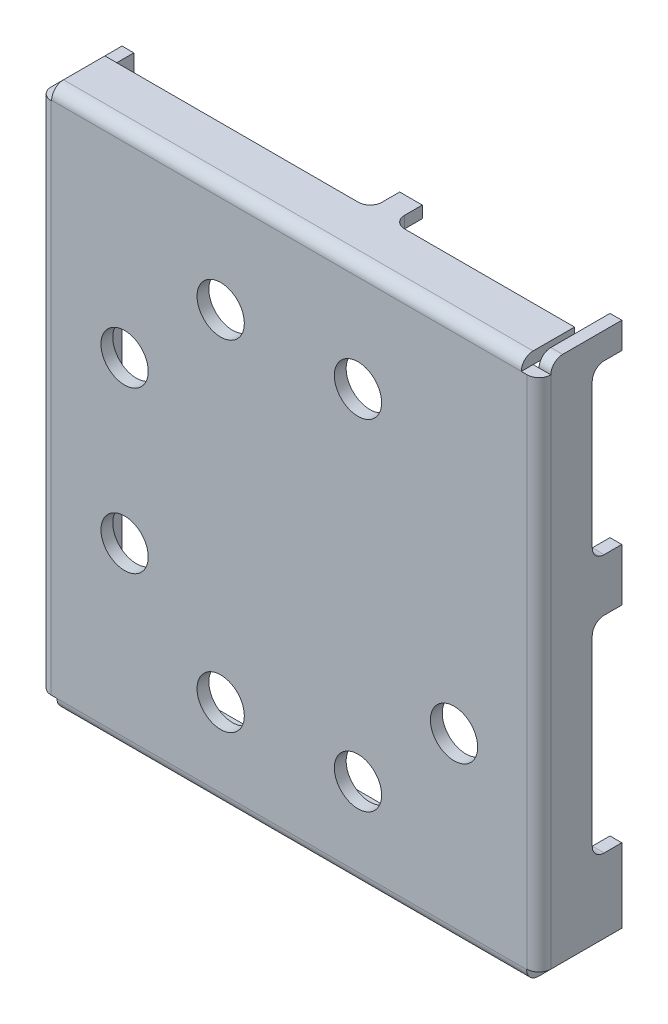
ISO-10303-21;
HEADER;
FILE_DESCRIPTION(('STEP AP214'),'2;1');
FILE_NAME('part.step','',(''),(''),'','','');
FILE_SCHEMA(('AUTOMOTIVE_DESIGN { 1 0 10303 214 1 1 1 1 }'));
ENDSEC;
DATA;
#1=APPLICATION_CONTEXT('core data for automotive mechanical design processes');
#2=APPLICATION_PROTOCOL_DEFINITION('international standard','automotive_design',2000,#1);
#3=PRODUCT_CONTEXT('',#1,'mechanical');
#4=PRODUCT('Part','Part','',(#3));
#5=PRODUCT_RELATED_PRODUCT_CATEGORY('part','',(#4));
#6=PRODUCT_DEFINITION_FORMATION('','',#4);
#7=PRODUCT_DEFINITION_CONTEXT('part definition',#1,'design');
#8=PRODUCT_DEFINITION('design','',#6,#7);
#9=PRODUCT_DEFINITION_SHAPE('','',#8);
#10=(LENGTH_UNIT() NAMED_UNIT(*) SI_UNIT(.MILLI.,.METRE.));
#11=(NAMED_UNIT(*) PLANE_ANGLE_UNIT() SI_UNIT($,.RADIAN.));
#12=(NAMED_UNIT(*) SI_UNIT($,.STERADIAN.) SOLID_ANGLE_UNIT());
#13=UNCERTAINTY_MEASURE_WITH_UNIT(LENGTH_MEASURE(1.E-05),#10,'distance_accuracy_value','');
#14=(GEOMETRIC_REPRESENTATION_CONTEXT(3) GLOBAL_UNCERTAINTY_ASSIGNED_CONTEXT((#13)) GLOBAL_UNIT_ASSIGNED_CONTEXT((#10,
#11,#12)) REPRESENTATION_CONTEXT('',''));
#15=CARTESIAN_POINT('',(0.,0.,0.));
#16=DIRECTION('',(0.,0.,1.));
#17=DIRECTION('',(1.,0.,0.));
#18=AXIS2_PLACEMENT_3D('',#15,#16,#17);
#19=CARTESIAN_POINT('',(8.743518,0.736651,1.4));
#20=DIRECTION('',(1.,0.,0.));
#21=DIRECTION('',(0.,0.,-1.));
#22=AXIS2_PLACEMENT_3D('',#19,#20,#21);
#23=PLANE('',#22);
#24=DIRECTION('',(0.,0.,-1.));
#25=VECTOR('',#24,1.);
#26=CARTESIAN_POINT('',(8.743518,0.746651,0.));
#27=LINE('',#26,#25);
#28=CARTESIAN_POINT('',(8.743518,0.746651,1.2));
#29=VERTEX_POINT('',#28);
#30=CARTESIAN_POINT('',(8.743518,0.746651,0.));
#31=VERTEX_POINT('',#30);
#32=EDGE_CURVE('E383',#29,#31,#27,.T.);
#33=ORIENTED_EDGE('',*,*,#32,.F.);
#34=CARTESIAN_POINT('',(8.743518,0.736651,1.2));
#35=CARTESIAN_POINT('',(8.743518,9.4536,1.2));
#36=B_SPLINE_CURVE_WITH_KNOTS('',1,(#34,#35),.UNSPECIFIED.,.F.,.F.,(2,2),(0.,1.),.UNSPECIFIED.);
#37=CARTESIAN_POINT('',(8.743518,9.4536,1.2));
#38=VERTEX_POINT('',#37);
#39=EDGE_CURVE('E413',#29,#38,#36,.T.);
#40=ORIENTED_EDGE('',*,*,#39,.T.);
#41=CARTESIAN_POINT('',(8.743518,9.4536,1.));
#42=DIRECTION('',(1.,0.,0.));
#43=DIRECTION('',(0.,0.,-1.));
#44=AXIS2_PLACEMENT_3D('',#41,#42,#43);
#45=CIRCLE('',#44,0.2);
#46=CARTESIAN_POINT('',(8.743518,9.6536,1.));
#47=VERTEX_POINT('',#46);
#48=EDGE_CURVE('E433',#47,#38,#45,.T.);
#49=ORIENTED_EDGE('',*,*,#48,.F.);
#50=DIRECTION('',(0.,0.,-1.));
#51=VECTOR('',#50,1.);
#52=CARTESIAN_POINT('',(8.743518,9.6536,0.500000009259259));
#53=LINE('',#52,#51);
#54=CARTESIAN_POINT('',(8.743518,9.6536,1.92043895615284E-08));
#55=VERTEX_POINT('',#54);
#56=EDGE_CURVE('E462',#47,#55,#53,.T.);
#57=ORIENTED_EDGE('',*,*,#56,.T.);
#58=DIRECTION('',(0.,1.,0.));
#59=VECTOR('',#58,1.);
#60=CARTESIAN_POINT('',(8.743518,9.43102,0.));
#61=LINE('',#60,#59);
#62=CARTESIAN_POINT('',(8.743518,9.20844,0.));
#63=VERTEX_POINT('',#62);
#64=EDGE_CURVE('E456',#63,#55,#61,.T.);
#65=ORIENTED_EDGE('',*,*,#64,.F.);
#66=DIRECTION('',(0.,0.,-1.));
#67=VECTOR('',#66,1.);
#68=CARTESIAN_POINT('',(8.743518,9.20844,0.15));
#69=LINE('',#68,#67);
#70=CARTESIAN_POINT('',(8.743518,9.20844,0.3));
#71=VERTEX_POINT('',#70);
#72=EDGE_CURVE('E444',#71,#63,#69,.T.);
#73=ORIENTED_EDGE('',*,*,#72,.F.);
#74=CARTESIAN_POINT('',(8.743518,9.00844,0.3));
#75=DIRECTION('',(-1.,0.,0.));
#76=DIRECTION('',(0.,0.,1.));
#77=AXIS2_PLACEMENT_3D('',#74,#75,#76);
#78=CIRCLE('',#77,0.2);
#79=CARTESIAN_POINT('',(8.743518,9.00844,0.5));
#80=VERTEX_POINT('',#79);
#81=EDGE_CURVE('E479',#80,#71,#78,.T.);
#82=ORIENTED_EDGE('',*,*,#81,.F.);
#83=DIRECTION('',(0.,1.,0.));
#84=VECTOR('',#83,1.);
#85=CARTESIAN_POINT('',(8.743518,7.788783,0.5));
#86=LINE('',#85,#84);
#87=CARTESIAN_POINT('',(8.743518,6.569126,0.5));
#88=VERTEX_POINT('',#87);
#89=EDGE_CURVE('E484',#88,#80,#86,.T.);
#90=ORIENTED_EDGE('',*,*,#89,.F.);
#91=CARTESIAN_POINT('',(8.743518,6.569126,0.3));
#92=DIRECTION('',(-1.,0.,0.));
#93=DIRECTION('',(0.,0.,1.));
#94=AXIS2_PLACEMENT_3D('',#91,#92,#93);
#95=CIRCLE('',#94,0.2);
#96=CARTESIAN_POINT('',(8.743518,6.369126,0.3));
#97=VERTEX_POINT('',#96);
#98=EDGE_CURVE('E488',#97,#88,#95,.T.);
#99=ORIENTED_EDGE('',*,*,#98,.F.);
#100=DIRECTION('',(0.,0.,-1.));
#101=VECTOR('',#100,1.);
#102=CARTESIAN_POINT('',(8.743518,6.369126,0.150000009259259));
#103=LINE('',#102,#101);
#104=CARTESIAN_POINT('',(8.743518,6.369126,1.92043895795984E-08));
#105=VERTEX_POINT('',#104);
#106=EDGE_CURVE('E505',#97,#105,#103,.T.);
#107=ORIENTED_EDGE('',*,*,#106,.T.);
#108=DIRECTION('',(0.,1.,0.));
#109=VECTOR('',#108,1.);
#110=CARTESIAN_POINT('',(8.743518,5.924931,0.));
#111=LINE('',#110,#109);
#112=CARTESIAN_POINT('',(8.743518,5.480736,0.));
#113=VERTEX_POINT('',#112);
#114=EDGE_CURVE('E508',#113,#105,#111,.T.);
#115=ORIENTED_EDGE('',*,*,#114,.F.);
#116=DIRECTION('',(0.,0.,-1.));
#117=VECTOR('',#116,1.);
#118=CARTESIAN_POINT('',(8.743518,5.480736,0.15));
#119=LINE('',#118,#117);
#120=CARTESIAN_POINT('',(8.743518,5.480736,0.3));
#121=VERTEX_POINT('',#120);
#122=EDGE_CURVE('E525',#121,#113,#119,.T.);
#123=ORIENTED_EDGE('',*,*,#122,.F.);
#124=CARTESIAN_POINT('',(8.743518,5.280736,0.3));
#125=DIRECTION('',(-1.,0.,0.));
#126=DIRECTION('',(0.,0.,1.));
#127=AXIS2_PLACEMENT_3D('',#124,#125,#126);
#128=CIRCLE('',#127,0.2);
#129=CARTESIAN_POINT('',(8.743518,5.280736,0.5));
#130=VERTEX_POINT('',#129);
#131=EDGE_CURVE('E542',#130,#121,#128,.T.);
#132=ORIENTED_EDGE('',*,*,#131,.F.);
#133=DIRECTION('',(0.,1.,0.));
#134=VECTOR('',#133,1.);
#135=CARTESIAN_POINT('',(8.743518,3.740023,0.5));
#136=LINE('',#135,#134);
#137=CARTESIAN_POINT('',(8.743518,2.19931,0.5));
#138=VERTEX_POINT('',#137);
#139=EDGE_CURVE('E547',#138,#130,#136,.T.);
#140=ORIENTED_EDGE('',*,*,#139,.F.);
#141=CARTESIAN_POINT('',(8.743518,2.19931,0.3));
#142=DIRECTION('',(-1.,0.,0.));
#143=DIRECTION('',(0.,0.,1.));
#144=AXIS2_PLACEMENT_3D('',#141,#142,#143);
#145=CIRCLE('',#144,0.2);
#146=CARTESIAN_POINT('',(8.743518,1.99931,0.3));
#147=VERTEX_POINT('',#146);
#148=EDGE_CURVE('E551',#147,#138,#145,.T.);
#149=ORIENTED_EDGE('',*,*,#148,.F.);
#150=DIRECTION('',(0.,0.,-1.));
#151=VECTOR('',#150,1.);
#152=CARTESIAN_POINT('',(8.743518,1.99931,0.150000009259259));
#153=LINE('',#152,#151);
#154=CARTESIAN_POINT('',(8.743518,1.99931,1.92043895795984E-08));
#155=VERTEX_POINT('',#154);
#156=EDGE_CURVE('E436',#147,#155,#153,.T.);
#157=ORIENTED_EDGE('',*,*,#156,.T.);
#158=CARTESIAN_POINT('',(8.743518,0.736651,0.));
#159=CARTESIAN_POINT('',(8.743518,1.99931,0.));
#160=B_SPLINE_CURVE_WITH_KNOTS('',1,(#158,#159),.UNSPECIFIED.,.F.,.F.,(2,2),(0.,1.),.UNSPECIFIED.);
#161=EDGE_CURVE('E37',#31,#155,#160,.T.);
#162=ORIENTED_EDGE('',*,*,#161,.F.);
#163=EDGE_LOOP('',(#33,#40,#49,#57,#65,#73,#82,#90,#99,#107,#115,#123,#132,#140,#149,#157,#162));
#164=FACE_BOUND('',#163,.T.);
#165=ADVANCED_FACE('F34',(#164),#23,.F.);
#166=CARTESIAN_POINT('',(8.843518,1.3679805,0.));
#167=DIRECTION('',(0.,0.,-1.));
#168=DIRECTION('',(-1.,0.,0.));
#169=AXIS2_PLACEMENT_3D('',#166,#167,#168);
#170=PLANE('',#169);
#171=DIRECTION('',(0.,1.,0.));
#172=VECTOR('',#171,1.);
#173=CARTESIAN_POINT('',(8.943518,0.736651,0.));
#174=LINE('',#173,#172);
#175=CARTESIAN_POINT('',(8.943518,0.746651,0.));
#176=VERTEX_POINT('',#175);
#177=CARTESIAN_POINT('',(8.943518,1.99931,0.));
#178=VERTEX_POINT('',#177);
#179=EDGE_CURVE('E579',#176,#178,#174,.T.);
#180=ORIENTED_EDGE('',*,*,#179,.F.);
#181=DIRECTION('',(1.,0.,0.));
#182=VECTOR('',#181,1.);
#183=CARTESIAN_POINT('',(8.943518,0.746651,0.));
#184=LINE('',#183,#182);
#185=EDGE_CURVE('E382',#31,#176,#184,.T.);
#186=ORIENTED_EDGE('',*,*,#185,.F.);
#187=ORIENTED_EDGE('',*,*,#161,.T.);
#188=DIRECTION('',(1.,0.,0.));
#189=VECTOR('',#188,1.);
#190=CARTESIAN_POINT('',(8.843518,1.99931,0.));
#191=LINE('',#190,#189);
#192=EDGE_CURVE('E576',#178,#155,#191,.F.);
#193=ORIENTED_EDGE('',*,*,#192,.F.);
#194=EDGE_LOOP('',(#180,#186,#187,#193));
#195=FACE_BOUND('',#194,.T.);
#196=ADVANCED_FACE('F1119',(#195),#170,.T.);
#197=CARTESIAN_POINT('',(8.943518,0.736651,1.4));
#198=DIRECTION('',(1.,0.,0.));
#199=DIRECTION('',(0.,0.,-1.));
#200=AXIS2_PLACEMENT_3D('',#197,#198,#199);
#201=PLANE('',#200);
#202=DIRECTION('',(0.,-1.,0.));
#203=VECTOR('',#202,1.);
#204=CARTESIAN_POINT('',(8.943518,9.4536,1.2));
#205=LINE('',#204,#203);
#206=CARTESIAN_POINT('',(8.943518,0.746650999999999,1.2));
#207=VERTEX_POINT('',#206);
#208=CARTESIAN_POINT('',(8.943518,9.4536,1.2));
#209=VERTEX_POINT('',#208);
#210=EDGE_CURVE('E459',#207,#209,#205,.F.);
#211=ORIENTED_EDGE('',*,*,#210,.F.);
#212=DIRECTION('',(0.,0.,1.));
#213=VECTOR('',#212,1.);
#214=CARTESIAN_POINT('',(8.943518,0.746651,0.));
#215=LINE('',#214,#213);
#216=EDGE_CURVE('E51',#176,#207,#215,.T.);
#217=ORIENTED_EDGE('',*,*,#216,.F.);
#218=ORIENTED_EDGE('',*,*,#179,.T.);
#219=DIRECTION('',(0.,0.,-1.));
#220=VECTOR('',#219,1.);
#221=CARTESIAN_POINT('',(8.943518,1.99931,1.4));
#222=LINE('',#221,#220);
#223=CARTESIAN_POINT('',(8.943518,1.99931,0.3));
#224=VERTEX_POINT('',#223);
#225=EDGE_CURVE('E561',#178,#224,#222,.F.);
#226=ORIENTED_EDGE('',*,*,#225,.T.);
#227=CARTESIAN_POINT('',(8.943518,2.19931,0.3));
#228=DIRECTION('',(-1.,0.,0.));
#229=DIRECTION('',(0.,0.,1.));
#230=AXIS2_PLACEMENT_3D('',#227,#228,#229);
#231=CIRCLE('',#230,0.2);
#232=CARTESIAN_POINT('',(8.943518,2.19931,0.5));
#233=VERTEX_POINT('',#232);
#234=EDGE_CURVE('E560',#224,#233,#231,.T.);
#235=ORIENTED_EDGE('',*,*,#234,.T.);
#236=DIRECTION('',(0.,1.,0.));
#237=VECTOR('',#236,1.);
#238=CARTESIAN_POINT('',(8.943518,0.736651,0.5));
#239=LINE('',#238,#237);
#240=CARTESIAN_POINT('',(8.943518,5.280736,0.5));
#241=VERTEX_POINT('',#240);
#242=EDGE_CURVE('E539',#233,#241,#239,.T.);
#243=ORIENTED_EDGE('',*,*,#242,.T.);
#244=CARTESIAN_POINT('',(8.943518,5.280736,0.3));
#245=DIRECTION('',(-1.,0.,0.));
#246=DIRECTION('',(0.,0.,1.));
#247=AXIS2_PLACEMENT_3D('',#244,#245,#246);
#248=CIRCLE('',#247,0.2);
#249=CARTESIAN_POINT('',(8.943518,5.480736,0.3));
#250=VERTEX_POINT('',#249);
#251=EDGE_CURVE('E538',#241,#250,#248,.T.);
#252=ORIENTED_EDGE('',*,*,#251,.T.);
#253=DIRECTION('',(0.,0.,-1.));
#254=VECTOR('',#253,1.);
#255=CARTESIAN_POINT('',(8.943518,5.480736,1.4));
#256=LINE('',#255,#254);
#257=CARTESIAN_POINT('',(8.943518,5.480736,0.));
#258=VERTEX_POINT('',#257);
#259=EDGE_CURVE('E528',#250,#258,#256,.T.);
#260=ORIENTED_EDGE('',*,*,#259,.T.);
#261=DIRECTION('',(0.,1.,0.));
#262=VECTOR('',#261,1.);
#263=CARTESIAN_POINT('',(8.943518,0.736651,0.));
#264=LINE('',#263,#262);
#265=CARTESIAN_POINT('',(8.943518,6.369126,0.));
#266=VERTEX_POINT('',#265);
#267=EDGE_CURVE('E517',#258,#266,#264,.T.);
#268=ORIENTED_EDGE('',*,*,#267,.T.);
#269=DIRECTION('',(0.,0.,-1.));
#270=VECTOR('',#269,1.);
#271=CARTESIAN_POINT('',(8.943518,6.369126,1.4));
#272=LINE('',#271,#270);
#273=CARTESIAN_POINT('',(8.943518,6.369126,0.3));
#274=VERTEX_POINT('',#273);
#275=EDGE_CURVE('E498',#266,#274,#272,.F.);
#276=ORIENTED_EDGE('',*,*,#275,.T.);
#277=CARTESIAN_POINT('',(8.943518,6.569126,0.3));
#278=DIRECTION('',(-1.,0.,0.));
#279=DIRECTION('',(0.,0.,1.));
#280=AXIS2_PLACEMENT_3D('',#277,#278,#279);
#281=CIRCLE('',#280,0.2);
#282=CARTESIAN_POINT('',(8.943518,6.569126,0.5));
#283=VERTEX_POINT('',#282);
#284=EDGE_CURVE('E497',#274,#283,#281,.T.);
#285=ORIENTED_EDGE('',*,*,#284,.T.);
#286=DIRECTION('',(0.,1.,0.));
#287=VECTOR('',#286,1.);
#288=CARTESIAN_POINT('',(8.943518,0.736651,0.5));
#289=LINE('',#288,#287);
#290=CARTESIAN_POINT('',(8.943518,9.00844,0.5));
#291=VERTEX_POINT('',#290);
#292=EDGE_CURVE('E476',#283,#291,#289,.T.);
#293=ORIENTED_EDGE('',*,*,#292,.T.);
#294=CARTESIAN_POINT('',(8.943518,9.00844,0.3));
#295=DIRECTION('',(-1.,0.,0.));
#296=DIRECTION('',(0.,0.,1.));
#297=AXIS2_PLACEMENT_3D('',#294,#295,#296);
#298=CIRCLE('',#297,0.2);
#299=CARTESIAN_POINT('',(8.943518,9.20844,0.3));
#300=VERTEX_POINT('',#299);
#301=EDGE_CURVE('E475',#291,#300,#298,.T.);
#302=ORIENTED_EDGE('',*,*,#301,.T.);
#303=DIRECTION('',(0.,0.,-1.));
#304=VECTOR('',#303,1.);
#305=CARTESIAN_POINT('',(8.943518,9.20844,1.4));
#306=LINE('',#305,#304);
#307=CARTESIAN_POINT('',(8.943518,9.20844,0.));
#308=VERTEX_POINT('',#307);
#309=EDGE_CURVE('E448',#300,#308,#306,.T.);
#310=ORIENTED_EDGE('',*,*,#309,.T.);
#311=DIRECTION('',(0.,1.,0.));
#312=VECTOR('',#311,1.);
#313=CARTESIAN_POINT('',(8.943518,0.736651,0.));
#314=LINE('',#313,#312);
#315=CARTESIAN_POINT('',(8.943518,9.6536,0.));
#316=VERTEX_POINT('',#315);
#317=EDGE_CURVE('E453',#308,#316,#314,.T.);
#318=ORIENTED_EDGE('',*,*,#317,.T.);
#319=DIRECTION('',(0.,0.,-1.));
#320=VECTOR('',#319,1.);
#321=CARTESIAN_POINT('',(8.943518,9.6536,1.4));
#322=LINE('',#321,#320);
#323=CARTESIAN_POINT('',(8.943518,9.6536,1.));
#324=VERTEX_POINT('',#323);
#325=EDGE_CURVE('E469',#316,#324,#322,.F.);
#326=ORIENTED_EDGE('',*,*,#325,.T.);
#327=CARTESIAN_POINT('',(8.943518,9.4536,1.));
#328=DIRECTION('',(1.,0.,0.));
#329=DIRECTION('',(0.,0.,-1.));
#330=AXIS2_PLACEMENT_3D('',#327,#328,#329);
#331=CIRCLE('',#330,0.2);
#332=EDGE_CURVE('E429',#324,#209,#331,.T.);
#333=ORIENTED_EDGE('',*,*,#332,.T.);
#334=EDGE_LOOP('',(#211,#217,#218,#226,#235,#243,#252,#260,#268,#276,#285,#293,#302,#310,#318,
#326,#333));
#335=FACE_BOUND('',#334,.T.);
#336=ADVANCED_FACE('F1123',(#335),#201,.T.);
#337=CARTESIAN_POINT('',(8.743518,9.4536,1.2));
#338=DIRECTION('',(0.,-1.,0.));
#339=DIRECTION('',(0.,0.,-1.));
#340=AXIS2_PLACEMENT_3D('',#337,#338,#339);
#341=CYLINDRICAL_SURFACE('',#340,0.2);
#342=DIRECTION('',(0.,1.,0.));
#343=VECTOR('',#342,1.);
#344=CARTESIAN_POINT('',(8.743518,0.,1.4));
#345=LINE('',#344,#343);
#346=CARTESIAN_POINT('',(8.743518,0.746651,1.4));
#347=VERTEX_POINT('',#346);
#348=CARTESIAN_POINT('',(8.743518,9.4536,1.4));
#349=VERTEX_POINT('',#348);
#350=EDGE_CURVE('E386',#347,#349,#345,.T.);
#351=ORIENTED_EDGE('',*,*,#350,.F.);
#352=CARTESIAN_POINT('',(8.743518,0.746650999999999,1.2));
#353=DIRECTION('',(0.,-1.,0.));
#354=DIRECTION('',(0.,0.,-1.));
#355=AXIS2_PLACEMENT_3D('',#352,#353,#354);
#356=CIRCLE('',#355,0.2);
#357=EDGE_CURVE('E11',#347,#207,#356,.F.);
#358=ORIENTED_EDGE('',*,*,#357,.T.);
#359=ORIENTED_EDGE('',*,*,#210,.T.);
#360=CARTESIAN_POINT('',(8.743518,9.4536,1.2));
#361=DIRECTION('',(0.,-1.,0.));
#362=DIRECTION('',(0.,0.,-1.));
#363=AXIS2_PLACEMENT_3D('',#360,#361,#362);
#364=CIRCLE('',#363,0.2);
#365=EDGE_CURVE('E389',#209,#349,#364,.T.);
#366=ORIENTED_EDGE('',*,*,#365,.T.);
#367=EDGE_LOOP('',(#351,#358,#359,#366));
#368=FACE_BOUND('',#367,.T.);
#369=ADVANCED_FACE('F387',(#368),#341,.T.);
#370=CARTESIAN_POINT('',(0.690042,0.736651,1.4));
#371=DIRECTION('',(0.,-1.,0.));
#372=DIRECTION('',(0.,0.,-1.));
#373=AXIS2_PLACEMENT_3D('',#370,#371,#372);
#374=PLANE('',#373);
#375=DIRECTION('',(0.,0.,1.));
#376=VECTOR('',#375,1.);
#377=CARTESIAN_POINT('',(8.733518,0.736651,0.2));
#378=LINE('',#377,#376);
#379=CARTESIAN_POINT('',(8.733518,0.736651,0.2));
#380=VERTEX_POINT('',#379);
#381=CARTESIAN_POINT('',(8.733518,0.736651,1.2));
#382=VERTEX_POINT('',#381);
#383=EDGE_CURVE('E965',#380,#382,#378,.T.);
#384=ORIENTED_EDGE('',*,*,#383,.F.);
#385=DIRECTION('',(1.,0.,0.));
#386=VECTOR('',#385,1.);
#387=CARTESIAN_POINT('',(0.690042,0.736651,0.2));
#388=LINE('',#387,#386);
#389=CARTESIAN_POINT('',(1.482268,0.736651,0.2));
#390=VERTEX_POINT('',#389);
#391=EDGE_CURVE('E799',#390,#380,#388,.T.);
#392=ORIENTED_EDGE('',*,*,#391,.F.);
#393=DIRECTION('',(0.,0.,-1.));
#394=VECTOR('',#393,1.);
#395=CARTESIAN_POINT('',(1.482268,0.736651,1.4));
#396=LINE('',#395,#394);
#397=CARTESIAN_POINT('',(1.482268,0.736651,0.3));
#398=VERTEX_POINT('',#397);
#399=EDGE_CURVE('E798',#398,#390,#396,.T.);
#400=ORIENTED_EDGE('',*,*,#399,.F.);
#401=CARTESIAN_POINT('',(1.282268,0.736651,0.3));
#402=DIRECTION('',(0.,1.,0.));
#403=DIRECTION('',(0.,0.,1.));
#404=AXIS2_PLACEMENT_3D('',#401,#402,#403);
#405=CIRCLE('',#404,0.2);
#406=CARTESIAN_POINT('',(1.282268,0.736651,0.5));
#407=VERTEX_POINT('',#406);
#408=EDGE_CURVE('E793',#407,#398,#405,.T.);
#409=ORIENTED_EDGE('',*,*,#408,.F.);
#410=DIRECTION('',(1.,0.,0.));
#411=VECTOR('',#410,1.);
#412=CARTESIAN_POINT('',(0.690042,0.736651,0.5));
#413=LINE('',#412,#411);
#414=CARTESIAN_POINT('',(0.790042,0.736651,0.5));
#415=VERTEX_POINT('',#414);
#416=EDGE_CURVE('E784',#415,#407,#413,.T.);
#417=ORIENTED_EDGE('',*,*,#416,.F.);
#418=DIRECTION('',(0.,0.,-1.));
#419=VECTOR('',#418,1.);
#420=CARTESIAN_POINT('',(0.790042,0.736651,1.4));
#421=LINE('',#420,#419);
#422=CARTESIAN_POINT('',(0.790042,0.736651,1.2));
#423=VERTEX_POINT('',#422);
#424=EDGE_CURVE('E807',#423,#415,#421,.T.);
#425=ORIENTED_EDGE('',*,*,#424,.F.);
#426=DIRECTION('',(1.,0.,0.));
#427=VECTOR('',#426,1.);
#428=CARTESIAN_POINT('',(0.,0.736651,1.2));
#429=LINE('',#428,#427);
#430=EDGE_CURVE('E832',#423,#382,#429,.T.);
#431=ORIENTED_EDGE('',*,*,#430,.T.);
#432=EDGE_LOOP('',(#384,#392,#400,#409,#417,#425,#431));
#433=FACE_BOUND('',#432,.T.);
#434=ADVANCED_FACE('F1079',(#433),#374,.F.);
#435=CARTESIAN_POINT('',(4.76678,0.636651,0.2));
#436=DIRECTION('',(0.,0.,-1.));
#437=DIRECTION('',(-1.,0.,0.));
#438=AXIS2_PLACEMENT_3D('',#435,#436,#437);
#439=PLANE('',#438);
#440=ORIENTED_EDGE('',*,*,#391,.T.);
#441=DIRECTION('',(0.,1.,0.));
#442=VECTOR('',#441,1.);
#443=CARTESIAN_POINT('',(8.733518,0.536651,0.2));
#444=LINE('',#443,#442);
#445=CARTESIAN_POINT('',(8.733518,0.536651,0.2));
#446=VERTEX_POINT('',#445);
#447=EDGE_CURVE('E959',#446,#380,#444,.T.);
#448=ORIENTED_EDGE('',*,*,#447,.F.);
#449=DIRECTION('',(1.,0.,0.));
#450=VECTOR('',#449,1.);
#451=CARTESIAN_POINT('',(0.690042,0.536651,0.2));
#452=LINE('',#451,#450);
#453=CARTESIAN_POINT('',(1.482268,0.536651,0.2));
#454=VERTEX_POINT('',#453);
#455=EDGE_CURVE('E1034',#454,#446,#452,.T.);
#456=ORIENTED_EDGE('',*,*,#455,.F.);
#457=DIRECTION('',(0.,1.,0.));
#458=VECTOR('',#457,1.);
#459=CARTESIAN_POINT('',(1.482268,0.636651,0.2));
#460=LINE('',#459,#458);
#461=EDGE_CURVE('E1044',#454,#390,#460,.T.);
#462=ORIENTED_EDGE('',*,*,#461,.T.);
#463=EDGE_LOOP('',(#440,#448,#456,#462));
#464=FACE_BOUND('',#463,.T.);
#465=ADVANCED_FACE('F1041',(#464),#439,.T.);
#466=CARTESIAN_POINT('',(0.690042,0.536651,1.4));
#467=DIRECTION('',(0.,-1.,0.));
#468=DIRECTION('',(0.,0.,-1.));
#469=AXIS2_PLACEMENT_3D('',#466,#467,#468);
#470=PLANE('',#469);
#471=ORIENTED_EDGE('',*,*,#455,.T.);
#472=DIRECTION('',(0.,0.,-1.));
#473=VECTOR('',#472,1.);
#474=CARTESIAN_POINT('',(8.733518,0.536651,0.2));
#475=LINE('',#474,#473);
#476=CARTESIAN_POINT('',(8.733518,0.536651,1.2));
#477=VERTEX_POINT('',#476);
#478=EDGE_CURVE('E968',#477,#446,#475,.T.);
#479=ORIENTED_EDGE('',*,*,#478,.F.);
#480=DIRECTION('',(-1.,0.,0.));
#481=VECTOR('',#480,1.);
#482=CARTESIAN_POINT('',(8.743518,0.536651,1.2));
#483=LINE('',#482,#481);
#484=CARTESIAN_POINT('',(0.790042,0.536651,1.2));
#485=VERTEX_POINT('',#484);
#486=EDGE_CURVE('E806',#485,#477,#483,.F.);
#487=ORIENTED_EDGE('',*,*,#486,.F.);
#488=DIRECTION('',(0.,0.,-1.));
#489=VECTOR('',#488,1.);
#490=CARTESIAN_POINT('',(0.790042,0.536651,1.4));
#491=LINE('',#490,#489);
#492=CARTESIAN_POINT('',(0.790042,0.536651,0.5));
#493=VERTEX_POINT('',#492);
#494=EDGE_CURVE('E803',#485,#493,#491,.T.);
#495=ORIENTED_EDGE('',*,*,#494,.T.);
#496=DIRECTION('',(1.,0.,0.));
#497=VECTOR('',#496,1.);
#498=CARTESIAN_POINT('',(0.690042,0.536651,0.5));
#499=LINE('',#498,#497);
#500=CARTESIAN_POINT('',(1.282268,0.536650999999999,0.5));
#501=VERTEX_POINT('',#500);
#502=EDGE_CURVE('E785',#493,#501,#499,.T.);
#503=ORIENTED_EDGE('',*,*,#502,.T.);
#504=CARTESIAN_POINT('',(1.282268,0.536650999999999,0.3));
#505=DIRECTION('',(0.,1.,0.));
#506=DIRECTION('',(0.,0.,1.));
#507=AXIS2_PLACEMENT_3D('',#504,#505,#506);
#508=CIRCLE('',#507,0.2);
#509=CARTESIAN_POINT('',(1.482268,0.536651,0.3));
#510=VERTEX_POINT('',#509);
#511=EDGE_CURVE('E790',#501,#510,#508,.T.);
#512=ORIENTED_EDGE('',*,*,#511,.T.);
#513=DIRECTION('',(0.,0.,-1.));
#514=VECTOR('',#513,1.);
#515=CARTESIAN_POINT('',(1.482268,0.536651,1.4));
#516=LINE('',#515,#514);
#517=EDGE_CURVE('E795',#510,#454,#516,.T.);
#518=ORIENTED_EDGE('',*,*,#517,.T.);
#519=EDGE_LOOP('',(#471,#479,#487,#495,#503,#512,#518));
#520=FACE_BOUND('',#519,.T.);
#521=ADVANCED_FACE('F1033',(#520),#470,.T.);
#522=CARTESIAN_POINT('',(8.743518,0.736651,1.2));
#523=DIRECTION('',(-1.,0.,0.));
#524=DIRECTION('',(0.,0.,1.));
#525=AXIS2_PLACEMENT_3D('',#522,#523,#524);
#526=CYLINDRICAL_SURFACE('',#525,0.2);
#527=ORIENTED_EDGE('',*,*,#486,.T.);
#528=CARTESIAN_POINT('',(8.733518,0.736651,1.2));
#529=DIRECTION('',(1.,0.,0.));
#530=DIRECTION('',(0.,0.,-1.));
#531=AXIS2_PLACEMENT_3D('',#528,#529,#530);
#532=CIRCLE('',#531,0.2);
#533=CARTESIAN_POINT('',(8.733518,0.736651,1.4));
#534=VERTEX_POINT('',#533);
#535=EDGE_CURVE('E43',#477,#534,#532,.F.);
#536=ORIENTED_EDGE('',*,*,#535,.T.);
#537=DIRECTION('',(1.,0.,0.));
#538=VECTOR('',#537,1.);
#539=CARTESIAN_POINT('',(0.,0.736651,1.4));
#540=LINE('',#539,#538);
#541=CARTESIAN_POINT('',(0.790042,0.736651,1.4));
#542=VERTEX_POINT('',#541);
#543=EDGE_CURVE('E407',#542,#534,#540,.T.);
#544=ORIENTED_EDGE('',*,*,#543,.F.);
#545=CARTESIAN_POINT('',(0.790041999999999,0.736651,1.2));
#546=DIRECTION('',(-1.,0.,0.));
#547=DIRECTION('',(0.,0.,1.));
#548=AXIS2_PLACEMENT_3D('',#545,#546,#547);
#549=CIRCLE('',#548,0.2);
#550=EDGE_CURVE('E800',#542,#485,#549,.F.);
#551=ORIENTED_EDGE('',*,*,#550,.T.);
#552=EDGE_LOOP('',(#527,#536,#544,#551));
#553=FACE_BOUND('',#552,.T.);
#554=ADVANCED_FACE('F1022',(#553),#526,.T.);
#555=CARTESIAN_POINT('',(8.743518,9.6536,1.4));
#556=DIRECTION('',(0.,1.,0.));
#557=DIRECTION('',(0.,0.,1.));
#558=AXIS2_PLACEMENT_3D('',#555,#556,#557);
#559=PLANE('',#558);
#560=DIRECTION('',(1.,0.,0.));
#561=VECTOR('',#560,1.);
#562=CARTESIAN_POINT('',(8.743518,9.6536,0.5));
#563=LINE('',#562,#561);
#564=CARTESIAN_POINT('',(4.986858,9.6536,0.5));
#565=VERTEX_POINT('',#564);
#566=CARTESIAN_POINT('',(0.700042,9.6536,0.5));
#567=VERTEX_POINT('',#566);
#568=EDGE_CURVE('E725',#565,#567,#563,.F.);
#569=ORIENTED_EDGE('',*,*,#568,.T.);
#570=DIRECTION('',(0.,0.,-1.));
#571=VECTOR('',#570,1.);
#572=CARTESIAN_POINT('',(0.700042,9.6536,0.5));
#573=LINE('',#572,#571);
#574=CARTESIAN_POINT('',(0.700042,9.6536,1.2));
#575=VERTEX_POINT('',#574);
#576=EDGE_CURVE('E979',#575,#567,#573,.T.);
#577=ORIENTED_EDGE('',*,*,#576,.F.);
#578=DIRECTION('',(1.,0.,0.));
#579=VECTOR('',#578,1.);
#580=CARTESIAN_POINT('',(0.690042,9.6536,1.2));
#581=LINE('',#580,#579);
#582=CARTESIAN_POINT('',(8.643518,9.6536,1.2));
#583=VERTEX_POINT('',#582);
#584=EDGE_CURVE('E810',#583,#575,#581,.F.);
#585=ORIENTED_EDGE('',*,*,#584,.F.);
#586=DIRECTION('',(0.,0.,1.));
#587=VECTOR('',#586,1.);
#588=CARTESIAN_POINT('',(8.643518,9.6536,1.4));
#589=LINE('',#588,#587);
#590=CARTESIAN_POINT('',(8.643518,9.6536,0.5));
#591=VERTEX_POINT('',#590);
#592=EDGE_CURVE('E702',#583,#591,#589,.F.);
#593=ORIENTED_EDGE('',*,*,#592,.T.);
#594=DIRECTION('',(1.,0.,0.));
#595=VECTOR('',#594,1.);
#596=CARTESIAN_POINT('',(8.743518,9.6536,0.5));
#597=LINE('',#596,#595);
#598=CARTESIAN_POINT('',(5.76928,9.6536,0.5));
#599=VERTEX_POINT('',#598);
#600=EDGE_CURVE('E695',#591,#599,#597,.F.);
#601=ORIENTED_EDGE('',*,*,#600,.T.);
#602=CARTESIAN_POINT('',(5.76928,9.6536,0.3));
#603=DIRECTION('',(0.,-1.,0.));
#604=DIRECTION('',(0.,0.,-1.));
#605=AXIS2_PLACEMENT_3D('',#602,#603,#604);
#606=CIRCLE('',#605,0.2);
#607=CARTESIAN_POINT('',(5.56928,9.6536,0.3));
#608=VERTEX_POINT('',#607);
#609=EDGE_CURVE('E722',#599,#608,#606,.T.);
#610=ORIENTED_EDGE('',*,*,#609,.T.);
#611=DIRECTION('',(0.,0.,1.));
#612=VECTOR('',#611,1.);
#613=CARTESIAN_POINT('',(5.56928,9.6536,1.4));
#614=LINE('',#613,#612);
#615=CARTESIAN_POINT('',(5.56928,9.6536,0.));
#616=VERTEX_POINT('',#615);
#617=EDGE_CURVE('E718',#608,#616,#614,.F.);
#618=ORIENTED_EDGE('',*,*,#617,.T.);
#619=DIRECTION('',(1.,0.,0.));
#620=VECTOR('',#619,1.);
#621=CARTESIAN_POINT('',(8.743518,9.6536,0.));
#622=LINE('',#621,#620);
#623=CARTESIAN_POINT('',(5.186858,9.6536,0.));
#624=VERTEX_POINT('',#623);
#625=EDGE_CURVE('E714',#616,#624,#622,.F.);
#626=ORIENTED_EDGE('',*,*,#625,.T.);
#627=DIRECTION('',(0.,0.,1.));
#628=VECTOR('',#627,1.);
#629=CARTESIAN_POINT('',(5.186858,9.6536,1.4));
#630=LINE('',#629,#628);
#631=CARTESIAN_POINT('',(5.186858,9.6536,0.3));
#632=VERTEX_POINT('',#631);
#633=EDGE_CURVE('E710',#624,#632,#630,.T.);
#634=ORIENTED_EDGE('',*,*,#633,.T.);
#635=CARTESIAN_POINT('',(4.986858,9.6536,0.3));
#636=DIRECTION('',(0.,-1.,0.));
#637=DIRECTION('',(0.,0.,-1.));
#638=AXIS2_PLACEMENT_3D('',#635,#636,#637);
#639=CIRCLE('',#638,0.2);
#640=EDGE_CURVE('E706',#632,#565,#639,.T.);
#641=ORIENTED_EDGE('',*,*,#640,.T.);
#642=EDGE_LOOP('',(#569,#577,#585,#593,#601,#610,#618,#626,#634,#641));
#643=FACE_BOUND('',#642,.T.);
#644=ADVANCED_FACE('F923',(#643),#559,.T.);
#645=CARTESIAN_POINT('',(2.93845,9.5536,0.5));
#646=DIRECTION('',(0.,0.,-1.));
#647=DIRECTION('',(-1.,0.,0.));
#648=AXIS2_PLACEMENT_3D('',#645,#646,#647);
#649=PLANE('',#648);
#650=CARTESIAN_POINT('',(0.690042,9.4536,0.5));
#651=CARTESIAN_POINT('',(4.986858,9.4536,0.5));
#652=B_SPLINE_CURVE_WITH_KNOTS('',1,(#650,#651),.UNSPECIFIED.,.F.,.F.,(2,2),(0.,1.),.UNSPECIFIED.);
#653=CARTESIAN_POINT('',(0.700042,9.4536,0.5));
#654=VERTEX_POINT('',#653);
#655=CARTESIAN_POINT('',(4.986858,9.4536,0.5));
#656=VERTEX_POINT('',#655);
#657=EDGE_CURVE('E596',#654,#656,#652,.T.);
#658=ORIENTED_EDGE('',*,*,#657,.F.);
#659=DIRECTION('',(0.,-1.,0.));
#660=VECTOR('',#659,1.);
#661=CARTESIAN_POINT('',(0.700042,9.6536,0.5));
#662=LINE('',#661,#660);
#663=EDGE_CURVE('E921',#567,#654,#662,.T.);
#664=ORIENTED_EDGE('',*,*,#663,.F.);
#665=ORIENTED_EDGE('',*,*,#568,.F.);
#666=DIRECTION('',(0.,1.,0.));
#667=VECTOR('',#666,1.);
#668=CARTESIAN_POINT('',(4.986858,9.5536,0.5));
#669=LINE('',#668,#667);
#670=EDGE_CURVE('E705',#565,#656,#669,.F.);
#671=ORIENTED_EDGE('',*,*,#670,.T.);
#672=EDGE_LOOP('',(#658,#664,#665,#671));
#673=FACE_BOUND('',#672,.T.);
#674=ADVANCED_FACE('F919',(#673),#649,.T.);
#675=CARTESIAN_POINT('',(0.690042,9.4536,1.2));
#676=DIRECTION('',(1.,0.,0.));
#677=DIRECTION('',(0.,0.,-1.));
#678=AXIS2_PLACEMENT_3D('',#675,#676,#677);
#679=CYLINDRICAL_SURFACE('',#678,0.2);
#680=ORIENTED_EDGE('',*,*,#584,.T.);
#681=CARTESIAN_POINT('',(0.700042,9.4536,1.2));
#682=DIRECTION('',(-1.,0.,0.));
#683=DIRECTION('',(0.,0.,1.));
#684=AXIS2_PLACEMENT_3D('',#681,#682,#683);
#685=CIRCLE('',#684,0.2);
#686=CARTESIAN_POINT('',(0.700042,9.4536,1.4));
#687=VERTEX_POINT('',#686);
#688=EDGE_CURVE('E988',#575,#687,#685,.F.);
#689=ORIENTED_EDGE('',*,*,#688,.T.);
#690=DIRECTION('',(1.,0.,0.));
#691=VECTOR('',#690,1.);
#692=CARTESIAN_POINT('',(0.,9.4536,1.4));
#693=LINE('',#692,#691);
#694=CARTESIAN_POINT('',(8.643518,9.4536,1.4));
#695=VERTEX_POINT('',#694);
#696=EDGE_CURVE('E730',#695,#687,#693,.F.);
#697=ORIENTED_EDGE('',*,*,#696,.F.);
#698=CARTESIAN_POINT('',(8.643518,9.4536,1.2));
#699=DIRECTION('',(1.,0.,0.));
#700=DIRECTION('',(0.,0.,-1.));
#701=AXIS2_PLACEMENT_3D('',#698,#699,#700);
#702=CIRCLE('',#701,0.2);
#703=EDGE_CURVE('E700',#695,#583,#702,.F.);
#704=ORIENTED_EDGE('',*,*,#703,.T.);
#705=EDGE_LOOP('',(#680,#689,#697,#704));
#706=FACE_BOUND('',#705,.T.);
#707=ADVANCED_FACE('F1206',(#706),#679,.T.);
#708=CARTESIAN_POINT('',(8.743518,9.4536,1.4));
#709=DIRECTION('',(0.,1.,0.));
#710=DIRECTION('',(0.,0.,1.));
#711=AXIS2_PLACEMENT_3D('',#708,#709,#710);
#712=PLANE('',#711);
#713=DIRECTION('',(0.,0.,1.));
#714=VECTOR('',#713,1.);
#715=CARTESIAN_POINT('',(0.700042,9.4536,1.4));
#716=LINE('',#715,#714);
#717=CARTESIAN_POINT('',(0.700042,9.4536,1.2));
#718=VERTEX_POINT('',#717);
#719=EDGE_CURVE('E916',#654,#718,#716,.T.);
#720=ORIENTED_EDGE('',*,*,#719,.F.);
#721=ORIENTED_EDGE('',*,*,#657,.T.);
#722=CARTESIAN_POINT('',(4.986858,9.4536,0.3));
#723=DIRECTION('',(0.,-1.,0.));
#724=DIRECTION('',(0.,0.,-1.));
#725=AXIS2_PLACEMENT_3D('',#722,#723,#724);
#726=CIRCLE('',#725,0.2);
#727=CARTESIAN_POINT('',(5.186858,9.4536,0.3));
#728=VERTEX_POINT('',#727);
#729=EDGE_CURVE('E593',#728,#656,#726,.T.);
#730=ORIENTED_EDGE('',*,*,#729,.F.);
#731=CARTESIAN_POINT('',(5.186858,9.4536,0.));
#732=CARTESIAN_POINT('',(5.186858,9.4536,0.3));
#733=B_SPLINE_CURVE_WITH_KNOTS('',1,(#731,#732),.UNSPECIFIED.,.F.,.F.,(2,2),(0.,1.),.UNSPECIFIED.);
#734=CARTESIAN_POINT('',(5.186858,9.4536,0.));
#735=VERTEX_POINT('',#734);
#736=EDGE_CURVE('E597',#735,#728,#733,.T.);
#737=ORIENTED_EDGE('',*,*,#736,.F.);
#738=CARTESIAN_POINT('',(5.186858,9.4536,0.));
#739=CARTESIAN_POINT('',(5.56927983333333,9.4536,0.));
#740=B_SPLINE_CURVE_WITH_KNOTS('',1,(#738,#739),.UNSPECIFIED.,.F.,.F.,(2,2),(0.,1.),.UNSPECIFIED.);
#741=CARTESIAN_POINT('',(5.56927977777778,9.4536,0.));
#742=VERTEX_POINT('',#741);
#743=EDGE_CURVE('E889',#735,#742,#740,.T.);
#744=ORIENTED_EDGE('',*,*,#743,.T.);
#745=CARTESIAN_POINT('',(5.56928,9.4536,0.));
#746=CARTESIAN_POINT('',(5.56928,9.4536,0.3));
#747=B_SPLINE_CURVE_WITH_KNOTS('',1,(#745,#746),.UNSPECIFIED.,.F.,.F.,(2,2),(0.,1.),.UNSPECIFIED.);
#748=CARTESIAN_POINT('',(5.56928,9.4536,0.3));
#749=VERTEX_POINT('',#748);
#750=EDGE_CURVE('E600',#742,#749,#747,.T.);
#751=ORIENTED_EDGE('',*,*,#750,.T.);
#752=CARTESIAN_POINT('',(5.76928,9.4536,0.3));
#753=DIRECTION('',(0.,-1.,0.));
#754=DIRECTION('',(0.,0.,-1.));
#755=AXIS2_PLACEMENT_3D('',#752,#753,#754);
#756=CIRCLE('',#755,0.2);
#757=CARTESIAN_POINT('',(5.76928,9.4536,0.5));
#758=VERTEX_POINT('',#757);
#759=EDGE_CURVE('E598',#758,#749,#756,.T.);
#760=ORIENTED_EDGE('',*,*,#759,.F.);
#761=CARTESIAN_POINT('',(5.76928,9.4536,0.5));
#762=CARTESIAN_POINT('',(8.64351783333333,9.4536,0.5));
#763=B_SPLINE_CURVE_WITH_KNOTS('',1,(#761,#762),.UNSPECIFIED.,.F.,.F.,(2,2),(0.,1.),.UNSPECIFIED.);
#764=CARTESIAN_POINT('',(8.64351777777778,9.4536,0.5));
#765=VERTEX_POINT('',#764);
#766=EDGE_CURVE('E601',#758,#765,#763,.T.);
#767=ORIENTED_EDGE('',*,*,#766,.T.);
#768=CARTESIAN_POINT('',(8.643518,9.4536,0.5));
#769=CARTESIAN_POINT('',(8.643518,9.4536,1.1999998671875));
#770=B_SPLINE_CURVE_WITH_KNOTS('',1,(#768,#769),.UNSPECIFIED.,.F.,.F.,(2,2),(0.,1.),.UNSPECIFIED.);
#771=CARTESIAN_POINT('',(8.643517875,9.4536,1.19999993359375));
#772=VERTEX_POINT('',#771);
#773=EDGE_CURVE('E857',#765,#772,#770,.T.);
#774=ORIENTED_EDGE('',*,*,#773,.T.);
#775=CARTESIAN_POINT('',(0.690042,9.4536,1.2));
#776=CARTESIAN_POINT('',(8.643518,9.4536,1.2));
#777=B_SPLINE_CURVE_WITH_KNOTS('',1,(#775,#776),.UNSPECIFIED.,.F.,.F.,(2,2),(0.,1.),.UNSPECIFIED.);
#778=EDGE_CURVE('E625',#718,#772,#777,.T.);
#779=ORIENTED_EDGE('',*,*,#778,.F.);
#780=EDGE_LOOP('',(#720,#721,#730,#737,#744,#751,#760,#767,#774,#779));
#781=FACE_BOUND('',#780,.T.);
#782=ADVANCED_FACE('F914',(#781),#712,.F.);
#783=CARTESIAN_POINT('',(0.690042,9.4536,1.4));
#784=DIRECTION('',(-1.,0.,0.));
#785=DIRECTION('',(0.,0.,1.));
#786=AXIS2_PLACEMENT_3D('',#783,#784,#785);
#787=PLANE('',#786);
#788=DIRECTION('',(0.,0.,-1.));
#789=VECTOR('',#788,1.);
#790=CARTESIAN_POINT('',(0.690042,9.4436,1.4));
#791=LINE('',#790,#789);
#792=CARTESIAN_POINT('',(0.690042,9.4436,1.2));
#793=VERTEX_POINT('',#792);
#794=CARTESIAN_POINT('',(0.690042,9.4436,0.));
#795=VERTEX_POINT('',#794);
#796=EDGE_CURVE('E991',#793,#795,#791,.T.);
#797=ORIENTED_EDGE('',*,*,#796,.F.);
#798=CARTESIAN_POINT('',(0.690042,0.73665100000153,1.2));
#799=CARTESIAN_POINT('',(0.690042,9.4536,1.2));
#800=B_SPLINE_CURVE_WITH_KNOTS('',1,(#798,#799),.UNSPECIFIED.,.F.,.F.,(2,2),(0.,1.),.UNSPECIFIED.);
#801=CARTESIAN_POINT('',(0.690041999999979,0.736651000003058,1.199999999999));
#802=VERTEX_POINT('',#801);
#803=EDGE_CURVE('E415',#802,#793,#800,.T.);
#804=ORIENTED_EDGE('',*,*,#803,.F.);
#805=CARTESIAN_POINT('',(0.690042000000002,0.816651,1.0166969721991));
#806=DIRECTION('',(-1.,0.,-1.222907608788E-13));
#807=DIRECTION('',(-1.222907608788E-13,0.,1.));
#808=AXIS2_PLACEMENT_3D('',#805,#806,#807);
#809=CIRCLE('',#808,0.2);
#810=CARTESIAN_POINT('',(0.690042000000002,0.616651,1.01669697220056));
#811=VERTEX_POINT('',#810);
#812=EDGE_CURVE('E580',#811,#802,#809,.T.);
#813=ORIENTED_EDGE('',*,*,#812,.F.);
#814=CARTESIAN_POINT('',(0.690042,0.616650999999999,0.));
#815=CARTESIAN_POINT('',(0.690042,0.616650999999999,1.01669697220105));
#816=B_SPLINE_CURVE_WITH_KNOTS('',1,(#814,#815),.UNSPECIFIED.,.F.,.F.,(2,2),(0.,1.),.UNSPECIFIED.);
#817=CARTESIAN_POINT('',(0.690042,0.616651,0.));
#818=VERTEX_POINT('',#817);
#819=EDGE_CURVE('E1821',#818,#811,#816,.T.);
#820=ORIENTED_EDGE('',*,*,#819,.F.);
#821=CARTESIAN_POINT('',(0.690042,0.616650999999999,0.));
#822=CARTESIAN_POINT('',(0.690042,1.01633,0.));
#823=B_SPLINE_CURVE_WITH_KNOTS('',1,(#821,#822),.UNSPECIFIED.,.F.,.F.,(2,2),(0.,1.),.UNSPECIFIED.);
#824=CARTESIAN_POINT('',(0.690041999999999,1.01633,0.));
#825=VERTEX_POINT('',#824);
#826=EDGE_CURVE('E617',#818,#825,#823,.T.);
#827=ORIENTED_EDGE('',*,*,#826,.T.);
#828=CARTESIAN_POINT('',(0.690041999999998,1.21633,0.));
#829=DIRECTION('',(1.,0.,0.));
#830=DIRECTION('',(0.,0.,-1.));
#831=AXIS2_PLACEMENT_3D('',#828,#829,#830);
#832=CIRCLE('',#831,0.2);
#833=CARTESIAN_POINT('',(0.690041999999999,1.21633,0.2));
#834=VERTEX_POINT('',#833);
#835=EDGE_CURVE('E1803',#834,#825,#832,.T.);
#836=ORIENTED_EDGE('',*,*,#835,.F.);
#837=CARTESIAN_POINT('',(0.690042,1.21633,0.2));
#838=CARTESIAN_POINT('',(0.690042,2.976956,0.2));
#839=B_SPLINE_CURVE_WITH_KNOTS('',1,(#837,#838),.UNSPECIFIED.,.F.,.F.,(2,2),(0.,1.),.UNSPECIFIED.);
#840=CARTESIAN_POINT('',(0.690041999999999,2.976956,0.2));
#841=VERTEX_POINT('',#840);
#842=EDGE_CURVE('E770',#834,#841,#839,.T.);
#843=ORIENTED_EDGE('',*,*,#842,.T.);
#844=CARTESIAN_POINT('',(0.690041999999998,2.976956,0.));
#845=DIRECTION('',(1.,0.,0.));
#846=DIRECTION('',(0.,0.,-1.));
#847=AXIS2_PLACEMENT_3D('',#844,#845,#846);
#848=CIRCLE('',#847,0.2);
#849=CARTESIAN_POINT('',(0.690041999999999,3.176956,0.));
#850=VERTEX_POINT('',#849);
#851=EDGE_CURVE('E1781',#850,#841,#848,.T.);
#852=ORIENTED_EDGE('',*,*,#851,.F.);
#853=CARTESIAN_POINT('',(0.690042,3.176956,0.));
#854=CARTESIAN_POINT('',(0.690042,3.459556,0.));
#855=B_SPLINE_CURVE_WITH_KNOTS('',1,(#853,#854),.UNSPECIFIED.,.F.,.F.,(2,2),(0.,1.),.UNSPECIFIED.);
#856=CARTESIAN_POINT('',(0.690041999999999,3.459556,0.));
#857=VERTEX_POINT('',#856);
#858=EDGE_CURVE('E763',#850,#857,#855,.T.);
#859=ORIENTED_EDGE('',*,*,#858,.T.);
#860=CARTESIAN_POINT('',(0.690041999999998,3.659556,0.));
#861=DIRECTION('',(1.,0.,0.));
#862=DIRECTION('',(0.,0.,-1.));
#863=AXIS2_PLACEMENT_3D('',#860,#861,#862);
#864=CIRCLE('',#863,0.2);
#865=CARTESIAN_POINT('',(0.690041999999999,3.659556,0.2));
#866=VERTEX_POINT('',#865);
#867=EDGE_CURVE('E760',#866,#857,#864,.T.);
#868=ORIENTED_EDGE('',*,*,#867,.F.);
#869=CARTESIAN_POINT('',(0.690042,3.659556,0.2));
#870=CARTESIAN_POINT('',(0.690042,8.598738,0.2));
#871=B_SPLINE_CURVE_WITH_KNOTS('',1,(#869,#870),.UNSPECIFIED.,.F.,.F.,(2,2),(0.,1.),.UNSPECIFIED.);
#872=CARTESIAN_POINT('',(0.690041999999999,8.598738,0.2));
#873=VERTEX_POINT('',#872);
#874=EDGE_CURVE('E1741',#866,#873,#871,.T.);
#875=ORIENTED_EDGE('',*,*,#874,.T.);
#876=CARTESIAN_POINT('',(0.690041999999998,8.598738,0.));
#877=DIRECTION('',(1.,0.,0.));
#878=DIRECTION('',(0.,0.,-1.));
#879=AXIS2_PLACEMENT_3D('',#876,#877,#878);
#880=CIRCLE('',#879,0.2);
#881=CARTESIAN_POINT('',(0.690041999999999,8.798738,0.));
#882=VERTEX_POINT('',#881);
#883=EDGE_CURVE('E751',#882,#873,#880,.T.);
#884=ORIENTED_EDGE('',*,*,#883,.F.);
#885=CARTESIAN_POINT('',(0.690042,8.798738,0.));
#886=CARTESIAN_POINT('',(0.690042,9.4536,0.));
#887=B_SPLINE_CURVE_WITH_KNOTS('',1,(#885,#886),.UNSPECIFIED.,.F.,.F.,(2,2),(0.,1.),.UNSPECIFIED.);
#888=EDGE_CURVE('E1024',#882,#795,#887,.T.);
#889=ORIENTED_EDGE('',*,*,#888,.T.);
#890=EDGE_LOOP('',(#797,#804,#813,#820,#827,#836,#843,#852,#859,#868,#875,#884,#889));
#891=FACE_BOUND('',#890,.T.);
#892=ADVANCED_FACE('F1216',(#891),#787,.F.);
#893=CARTESIAN_POINT('',(0.590042,9.126169,0.));
#894=DIRECTION('',(0.,0.,-1.));
#895=DIRECTION('',(-1.,0.,0.));
#896=AXIS2_PLACEMENT_3D('',#893,#894,#895);
#897=PLANE('',#896);
#898=DIRECTION('',(0.,1.,0.));
#899=VECTOR('',#898,1.);
#900=CARTESIAN_POINT('',(0.490042,9.4536,0.));
#901=LINE('',#900,#899);
#902=CARTESIAN_POINT('',(0.490042,9.4436,0.));
#903=VERTEX_POINT('',#902);
#904=CARTESIAN_POINT('',(0.490042,8.798738,0.));
#905=VERTEX_POINT('',#904);
#906=EDGE_CURVE('E619',#903,#905,#901,.F.);
#907=ORIENTED_EDGE('',*,*,#906,.F.);
#908=DIRECTION('',(-1.,0.,0.));
#909=VECTOR('',#908,1.);
#910=CARTESIAN_POINT('',(0.690042,9.4436,0.));
#911=LINE('',#910,#909);
#912=EDGE_CURVE('E993',#795,#903,#911,.T.);
#913=ORIENTED_EDGE('',*,*,#912,.F.);
#914=ORIENTED_EDGE('',*,*,#888,.F.);
#915=DIRECTION('',(1.,0.,0.));
#916=VECTOR('',#915,1.);
#917=CARTESIAN_POINT('',(-18.8849177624,8.798738,0.));
#918=LINE('',#917,#916);
#919=EDGE_CURVE('E622',#882,#905,#918,.F.);
#920=ORIENTED_EDGE('',*,*,#919,.T.);
#921=EDGE_LOOP('',(#907,#913,#914,#920));
#922=FACE_BOUND('',#921,.T.);
#923=ADVANCED_FACE('F1213',(#922),#897,.T.);
#924=CARTESIAN_POINT('',(0.490042,9.4536,1.4));
#925=DIRECTION('',(-1.,0.,0.));
#926=DIRECTION('',(0.,0.,1.));
#927=AXIS2_PLACEMENT_3D('',#924,#925,#926);
#928=PLANE('',#927);
#929=DIRECTION('',(0.,1.,0.));
#930=VECTOR('',#929,1.);
#931=CARTESIAN_POINT('',(0.490042,0.736651,1.2));
#932=LINE('',#931,#930);
#933=CARTESIAN_POINT('',(0.490042,9.4436,1.2));
#934=VERTEX_POINT('',#933);
#935=CARTESIAN_POINT('',(0.490042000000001,0.736651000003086,1.199999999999));
#936=VERTEX_POINT('',#935);
#937=EDGE_CURVE('E604',#934,#936,#932,.F.);
#938=ORIENTED_EDGE('',*,*,#937,.F.);
#939=DIRECTION('',(0.,0.,1.));
#940=VECTOR('',#939,1.);
#941=CARTESIAN_POINT('',(0.490042,9.4436,1.4));
#942=LINE('',#941,#940);
#943=EDGE_CURVE('E603',#903,#934,#942,.T.);
#944=ORIENTED_EDGE('',*,*,#943,.F.);
#945=ORIENTED_EDGE('',*,*,#906,.T.);
#946=CARTESIAN_POINT('',(0.490042,8.598738,0.));
#947=DIRECTION('',(1.,0.,0.));
#948=DIRECTION('',(0.,0.,-1.));
#949=AXIS2_PLACEMENT_3D('',#946,#947,#948);
#950=CIRCLE('',#949,0.2);
#951=CARTESIAN_POINT('',(0.490042,8.598738,0.2));
#952=VERTEX_POINT('',#951);
#953=EDGE_CURVE('E748',#905,#952,#950,.T.);
#954=ORIENTED_EDGE('',*,*,#953,.T.);
#955=DIRECTION('',(0.,1.,0.));
#956=VECTOR('',#955,1.);
#957=CARTESIAN_POINT('',(0.490042,9.4536,0.2));
#958=LINE('',#957,#956);
#959=CARTESIAN_POINT('',(0.490042,3.659556,0.2));
#960=VERTEX_POINT('',#959);
#961=EDGE_CURVE('E752',#952,#960,#958,.F.);
#962=ORIENTED_EDGE('',*,*,#961,.T.);
#963=CARTESIAN_POINT('',(0.490042,3.659556,0.));
#964=DIRECTION('',(1.,0.,0.));
#965=DIRECTION('',(0.,0.,-1.));
#966=AXIS2_PLACEMENT_3D('',#963,#964,#965);
#967=CIRCLE('',#966,0.2);
#968=CARTESIAN_POINT('',(0.490042,3.459556,0.));
#969=VERTEX_POINT('',#968);
#970=EDGE_CURVE('E757',#960,#969,#967,.T.);
#971=ORIENTED_EDGE('',*,*,#970,.T.);
#972=DIRECTION('',(0.,1.,0.));
#973=VECTOR('',#972,1.);
#974=CARTESIAN_POINT('',(0.490042,9.4536,0.));
#975=LINE('',#974,#973);
#976=CARTESIAN_POINT('',(0.490042,3.176956,0.));
#977=VERTEX_POINT('',#976);
#978=EDGE_CURVE('E761',#969,#977,#975,.F.);
#979=ORIENTED_EDGE('',*,*,#978,.T.);
#980=CARTESIAN_POINT('',(0.490042,2.976956,0.));
#981=DIRECTION('',(1.,0.,0.));
#982=DIRECTION('',(0.,0.,-1.));
#983=AXIS2_PLACEMENT_3D('',#980,#981,#982);
#984=CIRCLE('',#983,0.2);
#985=CARTESIAN_POINT('',(0.490042,2.976956,0.2));
#986=VERTEX_POINT('',#985);
#987=EDGE_CURVE('E764',#977,#986,#984,.T.);
#988=ORIENTED_EDGE('',*,*,#987,.T.);
#989=DIRECTION('',(0.,1.,0.));
#990=VECTOR('',#989,1.);
#991=CARTESIAN_POINT('',(0.490042,9.4536,0.2));
#992=LINE('',#991,#990);
#993=CARTESIAN_POINT('',(0.490042,1.21633,0.2));
#994=VERTEX_POINT('',#993);
#995=EDGE_CURVE('E767',#986,#994,#992,.F.);
#996=ORIENTED_EDGE('',*,*,#995,.T.);
#997=CARTESIAN_POINT('',(0.490042,1.21633,0.));
#998=DIRECTION('',(1.,0.,0.));
#999=DIRECTION('',(0.,0.,-1.));
#1000=AXIS2_PLACEMENT_3D('',#997,#998,#999);
#1001=CIRCLE('',#1000,0.2);
#1002=CARTESIAN_POINT('',(0.490042,1.01633,0.));
#1003=VERTEX_POINT('',#1002);
#1004=EDGE_CURVE('E771',#994,#1003,#1001,.T.);
#1005=ORIENTED_EDGE('',*,*,#1004,.T.);
#1006=DIRECTION('',(0.,1.,0.));
#1007=VECTOR('',#1006,1.);
#1008=CARTESIAN_POINT('',(0.490042,9.4536,0.));
#1009=LINE('',#1008,#1007);
#1010=CARTESIAN_POINT('',(0.490042,0.616651,0.));
#1011=VERTEX_POINT('',#1010);
#1012=EDGE_CURVE('E774',#1003,#1011,#1009,.F.);
#1013=ORIENTED_EDGE('',*,*,#1012,.T.);
#1014=DIRECTION('',(0.,0.,1.));
#1015=VECTOR('',#1014,1.);
#1016=CARTESIAN_POINT('',(0.490042,0.616650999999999,1.4));
#1017=LINE('',#1016,#1015);
#1018=CARTESIAN_POINT('',(0.490042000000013,0.616651,1.01669697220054));
#1019=VERTEX_POINT('',#1018);
#1020=EDGE_CURVE('E443',#1011,#1019,#1017,.T.);
#1021=ORIENTED_EDGE('',*,*,#1020,.T.);
#1022=CARTESIAN_POINT('',(0.490042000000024,0.816651,1.01669697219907));
#1023=DIRECTION('',(-1.,0.,-1.222907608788E-13));
#1024=DIRECTION('',(-1.222907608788E-13,0.,1.));
#1025=AXIS2_PLACEMENT_3D('',#1022,#1023,#1024);
#1026=CIRCLE('',#1025,0.2);
#1027=EDGE_CURVE('E442',#1019,#936,#1026,.T.);
#1028=ORIENTED_EDGE('',*,*,#1027,.T.);
#1029=EDGE_LOOP('',(#938,#944,#945,#954,#962,#971,#979,#988,#996,#1005,#1013,#1021,#1028));
#1030=FACE_BOUND('',#1029,.T.);
#1031=ADVANCED_FACE('F1008',(#1030),#928,.T.);
#1032=CARTESIAN_POINT('',(0.690042,0.736651,1.2));
#1033=DIRECTION('',(0.,1.,0.));
#1034=DIRECTION('',(0.,0.,1.));
#1035=AXIS2_PLACEMENT_3D('',#1032,#1033,#1034);
#1036=CYLINDRICAL_SURFACE('',#1035,0.2);
#1037=DIRECTION('',(0.,1.,0.));
#1038=VECTOR('',#1037,1.);
#1039=CARTESIAN_POINT('',(0.690042,0.,1.4));
#1040=LINE('',#1039,#1038);
#1041=CARTESIAN_POINT('',(0.690042,9.4436,1.4));
#1042=VERTEX_POINT('',#1041);
#1043=CARTESIAN_POINT('',(0.690042,0.73665100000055,1.4));
#1044=VERTEX_POINT('',#1043);
#1045=EDGE_CURVE('E397',#1042,#1044,#1040,.F.);
#1046=ORIENTED_EDGE('',*,*,#1045,.F.);
#1047=CARTESIAN_POINT('',(0.690042,9.4436,1.2));
#1048=DIRECTION('',(0.,1.,0.));
#1049=DIRECTION('',(0.,0.,1.));
#1050=AXIS2_PLACEMENT_3D('',#1047,#1048,#1049);
#1051=CIRCLE('',#1050,0.2);
#1052=EDGE_CURVE('E608',#1042,#934,#1051,.F.);
#1053=ORIENTED_EDGE('',*,*,#1052,.T.);
#1054=ORIENTED_EDGE('',*,*,#937,.T.);
#1055=CARTESIAN_POINT('',(0.690042,0.7366510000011,1.2));
#1056=DIRECTION('',(0.,1.,0.));
#1057=DIRECTION('',(0.,0.,1.));
#1058=AXIS2_PLACEMENT_3D('',#1055,#1056,#1057);
#1059=CIRCLE('',#1058,0.2);
#1060=EDGE_CURVE('E607',#936,#1044,#1059,.T.);
#1061=ORIENTED_EDGE('',*,*,#1060,.T.);
#1062=EDGE_LOOP('',(#1046,#1053,#1054,#1061));
#1063=FACE_BOUND('',#1062,.T.);
#1064=ADVANCED_FACE('F1006',(#1063),#1036,.T.);
#1065=CARTESIAN_POINT('',(8.814228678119,0.736651,1.270710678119));
#1066=DIRECTION('',(0.,1.,0.));
#1067=DIRECTION('',(0.,0.,1.));
#1068=AXIS2_PLACEMENT_3D('',#1065,#1066,#1067);
#1069=PLANE('',#1068);
#1070=DIRECTION('',(-1.,0.,0.));
#1071=VECTOR('',#1070,1.);
#1072=CARTESIAN_POINT('',(0.,0.736651,1.2));
#1073=LINE('',#1072,#1071);
#1074=CARTESIAN_POINT('',(8.743518,0.736651,1.2));
#1075=VERTEX_POINT('',#1074);
#1076=EDGE_CURVE('E970',#1075,#382,#1073,.T.);
#1077=ORIENTED_EDGE('',*,*,#1076,.F.);
#1078=DIRECTION('',(0.,0.,-1.));
#1079=VECTOR('',#1078,1.);
#1080=CARTESIAN_POINT('',(8.743518,0.736651,0.));
#1081=LINE('',#1080,#1079);
#1082=CARTESIAN_POINT('',(8.743518,0.736651,1.4));
#1083=VERTEX_POINT('',#1082);
#1084=EDGE_CURVE('E955',#1083,#1075,#1081,.T.);
#1085=ORIENTED_EDGE('',*,*,#1084,.F.);
#1086=DIRECTION('',(1.,0.,0.));
#1087=VECTOR('',#1086,1.);
#1088=CARTESIAN_POINT('',(8.733518,0.736651,1.4));
#1089=LINE('',#1088,#1087);
#1090=EDGE_CURVE('E58',#534,#1083,#1089,.T.);
#1091=ORIENTED_EDGE('',*,*,#1090,.F.);
#1092=EDGE_CURVE('E964',#382,#534,#378,.T.);
#1093=ORIENTED_EDGE('',*,*,#1092,.F.);
#1094=EDGE_LOOP('',(#1077,#1085,#1091,#1093));
#1095=FACE_BOUND('',#1094,.T.);
#1096=ADVANCED_FACE('F1101',(#1095),#1069,.F.);
#1097=CARTESIAN_POINT('',(8.843518,9.6536,0.85));
#1098=DIRECTION('',(0.,1.,0.));
#1099=DIRECTION('',(0.,0.,1.));
#1100=AXIS2_PLACEMENT_3D('',#1097,#1098,#1099);
#1101=PLANE('',#1100);
#1102=ORIENTED_EDGE('',*,*,#56,.F.);
#1103=DIRECTION('',(1.,0.,0.));
#1104=VECTOR('',#1103,1.);
#1105=CARTESIAN_POINT('',(-18.53658708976,9.6536,1.));
#1106=LINE('',#1105,#1104);
#1107=EDGE_CURVE('E464',#324,#47,#1106,.F.);
#1108=ORIENTED_EDGE('',*,*,#1107,.F.);
#1109=ORIENTED_EDGE('',*,*,#325,.F.);
#1110=DIRECTION('',(1.,0.,0.));
#1111=VECTOR('',#1110,1.);
#1112=CARTESIAN_POINT('',(8.843518,9.6536,0.));
#1113=LINE('',#1112,#1111);
#1114=EDGE_CURVE('E430',#316,#55,#1113,.F.);
#1115=ORIENTED_EDGE('',*,*,#1114,.T.);
#1116=EDGE_LOOP('',(#1102,#1108,#1109,#1115));
#1117=FACE_BOUND('',#1116,.T.);
#1118=ADVANCED_FACE('F1103',(#1117),#1101,.T.);
#1119=CARTESIAN_POINT('',(-18.53658708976,9.4536,1.));
#1120=DIRECTION('',(1.,0.,0.));
#1121=DIRECTION('',(0.,0.,-1.));
#1122=AXIS2_PLACEMENT_3D('',#1119,#1120,#1121);
#1123=CYLINDRICAL_SURFACE('',#1122,0.2);
#1124=DIRECTION('',(1.,0.,0.));
#1125=VECTOR('',#1124,1.);
#1126=CARTESIAN_POINT('',(8.814228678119,9.4536,1.2));
#1127=LINE('',#1126,#1125);
#1128=EDGE_CURVE('E422',#209,#38,#1127,.F.);
#1129=ORIENTED_EDGE('',*,*,#1128,.F.);
#1130=ORIENTED_EDGE('',*,*,#332,.F.);
#1131=ORIENTED_EDGE('',*,*,#1107,.T.);
#1132=ORIENTED_EDGE('',*,*,#48,.T.);
#1133=EDGE_LOOP('',(#1129,#1130,#1131,#1132));
#1134=FACE_BOUND('',#1133,.T.);
#1135=ADVANCED_FACE('F1109',(#1134),#1123,.T.);
#1136=CARTESIAN_POINT('',(8.843518,1.99931,0.25));
#1137=DIRECTION('',(0.,1.,0.));
#1138=DIRECTION('',(0.,0.,1.));
#1139=AXIS2_PLACEMENT_3D('',#1136,#1137,#1138);
#1140=PLANE('',#1139);
#1141=ORIENTED_EDGE('',*,*,#156,.F.);
#1142=DIRECTION('',(-1.,0.,0.));
#1143=VECTOR('',#1142,1.);
#1144=CARTESIAN_POINT('',(28.85122213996,1.99931,0.3));
#1145=LINE('',#1144,#1143);
#1146=EDGE_CURVE('E570',#147,#224,#1145,.F.);
#1147=ORIENTED_EDGE('',*,*,#1146,.T.);
#1148=ORIENTED_EDGE('',*,*,#225,.F.);
#1149=ORIENTED_EDGE('',*,*,#192,.T.);
#1150=EDGE_LOOP('',(#1141,#1147,#1148,#1149));
#1151=FACE_BOUND('',#1150,.T.);
#1152=ADVANCED_FACE('F1134',(#1151),#1140,.T.);
#1153=CARTESIAN_POINT('',(28.85122213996,2.19931,0.3));
#1154=DIRECTION('',(-1.,0.,0.));
#1155=DIRECTION('',(0.,0.,1.));
#1156=AXIS2_PLACEMENT_3D('',#1153,#1154,#1155);
#1157=CYLINDRICAL_SURFACE('',#1156,0.2);
#1158=DIRECTION('',(-1.,0.,0.));
#1159=VECTOR('',#1158,1.);
#1160=CARTESIAN_POINT('',(8.843518,2.19931,0.5));
#1161=LINE('',#1160,#1159);
#1162=EDGE_CURVE('E557',#233,#138,#1161,.T.);
#1163=ORIENTED_EDGE('',*,*,#1162,.F.);
#1164=ORIENTED_EDGE('',*,*,#234,.F.);
#1165=ORIENTED_EDGE('',*,*,#1146,.F.);
#1166=ORIENTED_EDGE('',*,*,#148,.T.);
#1167=EDGE_LOOP('',(#1163,#1164,#1165,#1166));
#1168=FACE_BOUND('',#1167,.T.);
#1169=ADVANCED_FACE('F1138',(#1168),#1157,.F.);
#1170=CARTESIAN_POINT('',(8.843518,3.740023,0.5));
#1171=DIRECTION('',(0.,0.,-1.));
#1172=DIRECTION('',(-1.,0.,0.));
#1173=AXIS2_PLACEMENT_3D('',#1170,#1171,#1172);
#1174=PLANE('',#1173);
#1175=ORIENTED_EDGE('',*,*,#139,.T.);
#1176=DIRECTION('',(-1.,0.,0.));
#1177=VECTOR('',#1176,1.);
#1178=CARTESIAN_POINT('',(30.77944552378,5.280736,0.5));
#1179=LINE('',#1178,#1177);
#1180=EDGE_CURVE('E550',#130,#241,#1179,.F.);
#1181=ORIENTED_EDGE('',*,*,#1180,.T.);
#1182=ORIENTED_EDGE('',*,*,#242,.F.);
#1183=ORIENTED_EDGE('',*,*,#1162,.T.);
#1184=EDGE_LOOP('',(#1175,#1181,#1182,#1183));
#1185=FACE_BOUND('',#1184,.T.);
#1186=ADVANCED_FACE('F1142',(#1185),#1174,.T.);
#1187=CARTESIAN_POINT('',(30.77944552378,5.280736,0.3));
#1188=DIRECTION('',(-1.,0.,0.));
#1189=DIRECTION('',(0.,0.,1.));
#1190=AXIS2_PLACEMENT_3D('',#1187,#1188,#1189);
#1191=CYLINDRICAL_SURFACE('',#1190,0.2);
#1192=DIRECTION('',(1.,0.,0.));
#1193=VECTOR('',#1192,1.);
#1194=CARTESIAN_POINT('',(8.843518,5.480736,0.3));
#1195=LINE('',#1194,#1193);
#1196=EDGE_CURVE('E535',#250,#121,#1195,.F.);
#1197=ORIENTED_EDGE('',*,*,#1196,.F.);
#1198=ORIENTED_EDGE('',*,*,#251,.F.);
#1199=ORIENTED_EDGE('',*,*,#1180,.F.);
#1200=ORIENTED_EDGE('',*,*,#131,.T.);
#1201=EDGE_LOOP('',(#1197,#1198,#1199,#1200));
#1202=FACE_BOUND('',#1201,.T.);
#1203=ADVANCED_FACE('F1146',(#1202),#1191,.F.);
#1204=CARTESIAN_POINT('',(8.843518,5.480736,0.25));
#1205=DIRECTION('',(0.,-1.,0.));
#1206=DIRECTION('',(0.,0.,-1.));
#1207=AXIS2_PLACEMENT_3D('',#1204,#1205,#1206);
#1208=PLANE('',#1207);
#1209=ORIENTED_EDGE('',*,*,#259,.F.);
#1210=ORIENTED_EDGE('',*,*,#1196,.T.);
#1211=ORIENTED_EDGE('',*,*,#122,.T.);
#1212=DIRECTION('',(-1.,0.,0.));
#1213=VECTOR('',#1212,1.);
#1214=CARTESIAN_POINT('',(8.843518,5.480736,0.));
#1215=LINE('',#1214,#1213);
#1216=EDGE_CURVE('E518',#258,#113,#1215,.T.);
#1217=ORIENTED_EDGE('',*,*,#1216,.F.);
#1218=EDGE_LOOP('',(#1209,#1210,#1211,#1217));
#1219=FACE_BOUND('',#1218,.T.);
#1220=ADVANCED_FACE('F1150',(#1219),#1208,.T.);
#1221=CARTESIAN_POINT('',(8.843518,5.924931,0.));
#1222=DIRECTION('',(0.,0.,-1.));
#1223=DIRECTION('',(-1.,0.,0.));
#1224=AXIS2_PLACEMENT_3D('',#1221,#1222,#1223);
#1225=PLANE('',#1224);
#1226=DIRECTION('',(1.,0.,0.));
#1227=VECTOR('',#1226,1.);
#1228=CARTESIAN_POINT('',(8.843518,6.369126,0.));
#1229=LINE('',#1228,#1227);
#1230=EDGE_CURVE('E514',#266,#105,#1229,.F.);
#1231=ORIENTED_EDGE('',*,*,#1230,.F.);
#1232=ORIENTED_EDGE('',*,*,#267,.F.);
#1233=ORIENTED_EDGE('',*,*,#1216,.T.);
#1234=ORIENTED_EDGE('',*,*,#114,.T.);
#1235=EDGE_LOOP('',(#1231,#1232,#1233,#1234));
#1236=FACE_BOUND('',#1235,.T.);
#1237=ADVANCED_FACE('F1154',(#1236),#1225,.T.);
#1238=CARTESIAN_POINT('',(8.843518,6.369126,0.25));
#1239=DIRECTION('',(0.,1.,0.));
#1240=DIRECTION('',(0.,0.,1.));
#1241=AXIS2_PLACEMENT_3D('',#1238,#1239,#1240);
#1242=PLANE('',#1241);
#1243=ORIENTED_EDGE('',*,*,#106,.F.);
#1244=DIRECTION('',(-1.,0.,0.));
#1245=VECTOR('',#1244,1.);
#1246=CARTESIAN_POINT('',(31.78072409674,6.369126,0.3));
#1247=LINE('',#1246,#1245);
#1248=EDGE_CURVE('E507',#97,#274,#1247,.F.);
#1249=ORIENTED_EDGE('',*,*,#1248,.T.);
#1250=ORIENTED_EDGE('',*,*,#275,.F.);
#1251=ORIENTED_EDGE('',*,*,#1230,.T.);
#1252=EDGE_LOOP('',(#1243,#1249,#1250,#1251));
#1253=FACE_BOUND('',#1252,.T.);
#1254=ADVANCED_FACE('F1158',(#1253),#1242,.T.);
#1255=CARTESIAN_POINT('',(31.78072409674,6.569126,0.3));
#1256=DIRECTION('',(-1.,0.,0.));
#1257=DIRECTION('',(0.,0.,1.));
#1258=AXIS2_PLACEMENT_3D('',#1255,#1256,#1257);
#1259=CYLINDRICAL_SURFACE('',#1258,0.2);
#1260=DIRECTION('',(-1.,0.,0.));
#1261=VECTOR('',#1260,1.);
#1262=CARTESIAN_POINT('',(8.843518,6.569126,0.5));
#1263=LINE('',#1262,#1261);
#1264=EDGE_CURVE('E494',#283,#88,#1263,.T.);
#1265=ORIENTED_EDGE('',*,*,#1264,.F.);
#1266=ORIENTED_EDGE('',*,*,#284,.F.);
#1267=ORIENTED_EDGE('',*,*,#1248,.F.);
#1268=ORIENTED_EDGE('',*,*,#98,.T.);
#1269=EDGE_LOOP('',(#1265,#1266,#1267,#1268));
#1270=FACE_BOUND('',#1269,.T.);
#1271=ADVANCED_FACE('F1162',(#1270),#1259,.F.);
#1272=CARTESIAN_POINT('',(8.843518,7.788783,0.5));
#1273=DIRECTION('',(0.,0.,-1.));
#1274=DIRECTION('',(-1.,0.,0.));
#1275=AXIS2_PLACEMENT_3D('',#1272,#1273,#1274);
#1276=PLANE('',#1275);
#1277=ORIENTED_EDGE('',*,*,#89,.T.);
#1278=DIRECTION('',(-1.,0.,0.));
#1279=VECTOR('',#1278,1.);
#1280=CARTESIAN_POINT('',(32.6094277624,9.00844,0.5));
#1281=LINE('',#1280,#1279);
#1282=EDGE_CURVE('E487',#80,#291,#1281,.F.);
#1283=ORIENTED_EDGE('',*,*,#1282,.T.);
#1284=ORIENTED_EDGE('',*,*,#292,.F.);
#1285=ORIENTED_EDGE('',*,*,#1264,.T.);
#1286=EDGE_LOOP('',(#1277,#1283,#1284,#1285));
#1287=FACE_BOUND('',#1286,.T.);
#1288=ADVANCED_FACE('F1166',(#1287),#1276,.T.);
#1289=CARTESIAN_POINT('',(32.6094277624,9.00844,0.3));
#1290=DIRECTION('',(-1.,0.,0.));
#1291=DIRECTION('',(0.,0.,1.));
#1292=AXIS2_PLACEMENT_3D('',#1289,#1290,#1291);
#1293=CYLINDRICAL_SURFACE('',#1292,0.2);
#1294=DIRECTION('',(1.,0.,0.));
#1295=VECTOR('',#1294,1.);
#1296=CARTESIAN_POINT('',(8.843518,9.20844,0.3));
#1297=LINE('',#1296,#1295);
#1298=EDGE_CURVE('E472',#300,#71,#1297,.F.);
#1299=ORIENTED_EDGE('',*,*,#1298,.F.);
#1300=ORIENTED_EDGE('',*,*,#301,.F.);
#1301=ORIENTED_EDGE('',*,*,#1282,.F.);
#1302=ORIENTED_EDGE('',*,*,#81,.T.);
#1303=EDGE_LOOP('',(#1299,#1300,#1301,#1302));
#1304=FACE_BOUND('',#1303,.T.);
#1305=ADVANCED_FACE('F1170',(#1304),#1293,.F.);
#1306=CARTESIAN_POINT('',(8.843518,9.20844,0.25));
#1307=DIRECTION('',(0.,-1.,0.));
#1308=DIRECTION('',(0.,0.,-1.));
#1309=AXIS2_PLACEMENT_3D('',#1306,#1307,#1308);
#1310=PLANE('',#1309);
#1311=ORIENTED_EDGE('',*,*,#309,.F.);
#1312=ORIENTED_EDGE('',*,*,#1298,.T.);
#1313=ORIENTED_EDGE('',*,*,#72,.T.);
#1314=DIRECTION('',(-1.,0.,0.));
#1315=VECTOR('',#1314,1.);
#1316=CARTESIAN_POINT('',(8.843518,9.20844,0.));
#1317=LINE('',#1316,#1315);
#1318=EDGE_CURVE('E447',#308,#63,#1317,.T.);
#1319=ORIENTED_EDGE('',*,*,#1318,.F.);
#1320=EDGE_LOOP('',(#1311,#1312,#1313,#1319));
#1321=FACE_BOUND('',#1320,.T.);
#1322=ADVANCED_FACE('F1174',(#1321),#1310,.T.);
#1323=CARTESIAN_POINT('',(8.843518,9.43102,0.));
#1324=DIRECTION('',(0.,0.,-1.));
#1325=DIRECTION('',(-1.,0.,0.));
#1326=AXIS2_PLACEMENT_3D('',#1323,#1324,#1325);
#1327=PLANE('',#1326);
#1328=ORIENTED_EDGE('',*,*,#1114,.F.);
#1329=ORIENTED_EDGE('',*,*,#317,.F.);
#1330=ORIENTED_EDGE('',*,*,#1318,.T.);
#1331=ORIENTED_EDGE('',*,*,#64,.T.);
#1332=EDGE_LOOP('',(#1328,#1329,#1330,#1331));
#1333=FACE_BOUND('',#1332,.T.);
#1334=ADVANCED_FACE('F1178',(#1333),#1327,.T.);
#1335=CARTESIAN_POINT('',(4.71678,9.4536,1.3));
#1336=DIRECTION('',(0.,1.,0.));
#1337=DIRECTION('',(0.,0.,1.));
#1338=AXIS2_PLACEMENT_3D('',#1335,#1336,#1337);
#1339=PLANE('',#1338);
#1340=DIRECTION('',(1.,0.,0.));
#1341=VECTOR('',#1340,1.);
#1342=CARTESIAN_POINT('',(0.,9.4536,1.4));
#1343=LINE('',#1342,#1341);
#1344=EDGE_CURVE('E668',#349,#695,#1343,.F.);
#1345=ORIENTED_EDGE('',*,*,#1344,.F.);
#1346=ORIENTED_EDGE('',*,*,#365,.F.);
#1347=ORIENTED_EDGE('',*,*,#1128,.T.);
#1348=DIRECTION('',(1.,0.,0.));
#1349=VECTOR('',#1348,1.);
#1350=CARTESIAN_POINT('',(4.71678,9.4536,1.2));
#1351=LINE('',#1350,#1349);
#1352=EDGE_CURVE('E671',#38,#772,#1351,.F.);
#1353=ORIENTED_EDGE('',*,*,#1352,.T.);
#1354=DIRECTION('',(0.,0.,1.));
#1355=VECTOR('',#1354,1.);
#1356=CARTESIAN_POINT('',(8.643518,9.4536,1.3));
#1357=LINE('',#1356,#1355);
#1358=EDGE_CURVE('E676',#772,#695,#1357,.T.);
#1359=ORIENTED_EDGE('',*,*,#1358,.T.);
#1360=EDGE_LOOP('',(#1345,#1346,#1347,#1353,#1359));
#1361=FACE_BOUND('',#1360,.T.);
#1362=ADVANCED_FACE('F946',(#1361),#1339,.T.);
#1363=CARTESIAN_POINT('',(0.,0.,1.2));
#1364=DIRECTION('',(0.,0.,1.));
#1365=DIRECTION('',(1.,0.,0.));
#1366=AXIS2_PLACEMENT_3D('',#1363,#1364,#1365);
#1367=PLANE('',#1366);
#1368=CARTESIAN_POINT('',(5.881280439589,7.814269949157,1.2));
#1369=DIRECTION('',(0.,0.,1.));
#1370=DIRECTION('',(1.,0.,0.));
#1371=AXIS2_PLACEMENT_3D('',#1368,#1369,#1370);
#1372=CIRCLE('',#1371,0.4);
#1373=CARTESIAN_POINT('',(6.281280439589,7.814269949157,1.2));
#1374=VERTEX_POINT('',#1373);
#1375=EDGE_CURVE('E672',#1374,#1374,#1372,.T.);
#1376=ORIENTED_EDGE('',*,*,#1375,.T.);
#1377=EDGE_LOOP('',(#1376));
#1378=FACE_BOUND('',#1377,.T.);
#1379=CARTESIAN_POINT('',(1.933738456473,3.581049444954,1.2));
#1380=DIRECTION('',(0.,0.,1.));
#1381=DIRECTION('',(1.,0.,0.));
#1382=AXIS2_PLACEMENT_3D('',#1379,#1380,#1381);
#1383=CIRCLE('',#1382,0.4);
#1384=CARTESIAN_POINT('',(2.333738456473,3.581049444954,1.2));
#1385=VERTEX_POINT('',#1384);
#1386=EDGE_CURVE('E675',#1385,#1385,#1383,.T.);
#1387=ORIENTED_EDGE('',*,*,#1386,.T.);
#1388=EDGE_LOOP('',(#1387));
#1389=FACE_BOUND('',#1388,.T.);
#1390=CARTESIAN_POINT('',(3.558719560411,2.065730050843,1.2));
#1391=DIRECTION('',(0.,0.,1.));
#1392=DIRECTION('',(1.,0.,0.));
#1393=AXIS2_PLACEMENT_3D('',#1390,#1391,#1392);
#1394=CIRCLE('',#1393,0.4);
#1395=CARTESIAN_POINT('',(3.958719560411,2.065730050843,1.2));
#1396=VERTEX_POINT('',#1395);
#1397=EDGE_CURVE('E679',#1396,#1396,#1394,.T.);
#1398=ORIENTED_EDGE('',*,*,#1397,.T.);
#1399=EDGE_LOOP('',(#1398));
#1400=FACE_BOUND('',#1399,.T.);
#1401=CARTESIAN_POINT('',(1.933738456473,6.298950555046,1.2));
#1402=DIRECTION('',(0.,0.,1.));
#1403=DIRECTION('',(1.,0.,0.));
#1404=AXIS2_PLACEMENT_3D('',#1401,#1402,#1403);
#1405=CIRCLE('',#1404,0.4);
#1406=CARTESIAN_POINT('',(2.333738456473,6.298950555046,1.2));
#1407=VERTEX_POINT('',#1406);
#1408=EDGE_CURVE('E682',#1407,#1407,#1405,.T.);
#1409=ORIENTED_EDGE('',*,*,#1408,.T.);
#1410=EDGE_LOOP('',(#1409));
#1411=FACE_BOUND('',#1410,.T.);
#1412=CARTESIAN_POINT('',(3.558719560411,7.814269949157,1.2));
#1413=DIRECTION('',(0.,0.,1.));
#1414=DIRECTION('',(1.,0.,0.));
#1415=AXIS2_PLACEMENT_3D('',#1412,#1413,#1414);
#1416=CIRCLE('',#1415,0.4);
#1417=CARTESIAN_POINT('',(3.958719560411,7.814269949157,1.2));
#1418=VERTEX_POINT('',#1417);
#1419=EDGE_CURVE('E685',#1418,#1418,#1416,.T.);
#1420=ORIENTED_EDGE('',*,*,#1419,.T.);
#1421=EDGE_LOOP('',(#1420));
#1422=FACE_BOUND('',#1421,.T.);
#1423=CARTESIAN_POINT('',(7.506261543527,3.581049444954,1.2));
#1424=DIRECTION('',(0.,0.,1.));
#1425=DIRECTION('',(1.,0.,0.));
#1426=AXIS2_PLACEMENT_3D('',#1423,#1424,#1425);
#1427=CIRCLE('',#1426,0.4);
#1428=CARTESIAN_POINT('',(7.906261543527,3.581049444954,1.2));
#1429=VERTEX_POINT('',#1428);
#1430=EDGE_CURVE('E688',#1429,#1429,#1427,.T.);
#1431=ORIENTED_EDGE('',*,*,#1430,.T.);
#1432=EDGE_LOOP('',(#1431));
#1433=FACE_BOUND('',#1432,.T.);
#1434=CARTESIAN_POINT('',(5.881280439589,2.065730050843,1.2));
#1435=DIRECTION('',(0.,0.,1.));
#1436=DIRECTION('',(1.,0.,0.));
#1437=AXIS2_PLACEMENT_3D('',#1434,#1435,#1436);
#1438=CIRCLE('',#1437,0.4);
#1439=CARTESIAN_POINT('',(6.281280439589,2.065730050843,1.2));
#1440=VERTEX_POINT('',#1439);
#1441=EDGE_CURVE('E691',#1440,#1440,#1438,.T.);
#1442=ORIENTED_EDGE('',*,*,#1441,.T.);
#1443=EDGE_LOOP('',(#1442));
#1444=FACE_BOUND('',#1443,.T.);
#1445=ORIENTED_EDGE('',*,*,#803,.T.);
#1446=DIRECTION('',(1.,0.,0.));
#1447=VECTOR('',#1446,1.);
#1448=CARTESIAN_POINT('',(0.,9.4436,1.2));
#1449=LINE('',#1448,#1447);
#1450=CARTESIAN_POINT('',(0.700042,9.4436,1.2));
#1451=VERTEX_POINT('',#1450);
#1452=EDGE_CURVE('E983',#793,#1451,#1449,.T.);
#1453=ORIENTED_EDGE('',*,*,#1452,.T.);
#1454=DIRECTION('',(0.,-1.,0.));
#1455=VECTOR('',#1454,1.);
#1456=CARTESIAN_POINT('',(0.700042,0.,1.2));
#1457=LINE('',#1456,#1455);
#1458=EDGE_CURVE('E986',#718,#1451,#1457,.T.);
#1459=ORIENTED_EDGE('',*,*,#1458,.F.);
#1460=ORIENTED_EDGE('',*,*,#778,.T.);
#1461=ORIENTED_EDGE('',*,*,#1352,.F.);
#1462=ORIENTED_EDGE('',*,*,#39,.F.);
#1463=EDGE_CURVE('E381',#1075,#29,#36,.T.);
#1464=ORIENTED_EDGE('',*,*,#1463,.F.);
#1465=ORIENTED_EDGE('',*,*,#1076,.T.);
#1466=ORIENTED_EDGE('',*,*,#430,.F.);
#1467=DIRECTION('',(1.,0.,0.));
#1468=VECTOR('',#1467,1.);
#1469=CARTESIAN_POINT('',(4.71678,0.736651,1.2));
#1470=LINE('',#1469,#1468);
#1471=EDGE_CURVE('E694',#802,#423,#1470,.T.);
#1472=ORIENTED_EDGE('',*,*,#1471,.F.);
#1473=EDGE_LOOP('',(#1445,#1453,#1459,#1460,#1461,#1462,#1464,#1465,#1466,#1472));
#1474=FACE_BOUND('',#1473,.T.);
#1475=ADVANCED_FACE('F949',(#1378,#1389,#1400,#1411,#1422,#1433,#1444,#1474),#1367,.F.);
#1476=CARTESIAN_POINT('',(7.106399,9.5536,0.5));
#1477=DIRECTION('',(0.,0.,-1.));
#1478=DIRECTION('',(-1.,0.,0.));
#1479=AXIS2_PLACEMENT_3D('',#1476,#1477,#1478);
#1480=PLANE('',#1479);
#1481=ORIENTED_EDGE('',*,*,#766,.F.);
#1482=DIRECTION('',(0.,-1.,0.));
#1483=VECTOR('',#1482,1.);
#1484=CARTESIAN_POINT('',(5.76928,24.0372204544,0.5));
#1485=LINE('',#1484,#1483);
#1486=EDGE_CURVE('E699',#758,#599,#1485,.F.);
#1487=ORIENTED_EDGE('',*,*,#1486,.T.);
#1488=ORIENTED_EDGE('',*,*,#600,.F.);
#1489=DIRECTION('',(0.,1.,0.));
#1490=VECTOR('',#1489,1.);
#1491=CARTESIAN_POINT('',(8.643518,9.5536,0.5));
#1492=LINE('',#1491,#1490);
#1493=EDGE_CURVE('E698',#765,#591,#1492,.T.);
#1494=ORIENTED_EDGE('',*,*,#1493,.F.);
#1495=EDGE_LOOP('',(#1481,#1487,#1488,#1494));
#1496=FACE_BOUND('',#1495,.T.);
#1497=ADVANCED_FACE('F940',(#1496),#1480,.T.);
#1498=CARTESIAN_POINT('',(8.643518,9.524310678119,1.270710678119));
#1499=DIRECTION('',(-1.,0.,0.));
#1500=DIRECTION('',(0.,0.,1.));
#1501=AXIS2_PLACEMENT_3D('',#1498,#1499,#1500);
#1502=PLANE('',#1501);
#1503=ORIENTED_EDGE('',*,*,#703,.F.);
#1504=ORIENTED_EDGE('',*,*,#1358,.F.);
#1505=ORIENTED_EDGE('',*,*,#773,.F.);
#1506=ORIENTED_EDGE('',*,*,#1493,.T.);
#1507=ORIENTED_EDGE('',*,*,#592,.F.);
#1508=EDGE_LOOP('',(#1503,#1504,#1505,#1506,#1507));
#1509=FACE_BOUND('',#1508,.T.);
#1510=ADVANCED_FACE('F943',(#1509),#1502,.F.);
#1511=CARTESIAN_POINT('',(4.986858,24.0372204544,0.3));
#1512=DIRECTION('',(0.,-1.,0.));
#1513=DIRECTION('',(0.,0.,-1.));
#1514=AXIS2_PLACEMENT_3D('',#1511,#1512,#1513);
#1515=CYLINDRICAL_SURFACE('',#1514,0.2);
#1516=ORIENTED_EDGE('',*,*,#670,.F.);
#1517=ORIENTED_EDGE('',*,*,#640,.F.);
#1518=DIRECTION('',(0.,-1.,0.));
#1519=VECTOR('',#1518,1.);
#1520=CARTESIAN_POINT('',(5.186858,24.0372204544,0.3));
#1521=LINE('',#1520,#1519);
#1522=EDGE_CURVE('E709',#728,#632,#1521,.F.);
#1523=ORIENTED_EDGE('',*,*,#1522,.F.);
#1524=ORIENTED_EDGE('',*,*,#729,.T.);
#1525=EDGE_LOOP('',(#1516,#1517,#1523,#1524));
#1526=FACE_BOUND('',#1525,.T.);
#1527=ADVANCED_FACE('F912',(#1526),#1515,.F.);
#1528=CARTESIAN_POINT('',(5.186858,9.5536,0.25));
#1529=DIRECTION('',(-1.,0.,0.));
#1530=DIRECTION('',(0.,0.,1.));
#1531=AXIS2_PLACEMENT_3D('',#1528,#1529,#1530);
#1532=PLANE('',#1531);
#1533=ORIENTED_EDGE('',*,*,#736,.T.);
#1534=ORIENTED_EDGE('',*,*,#1522,.T.);
#1535=ORIENTED_EDGE('',*,*,#633,.F.);
#1536=DIRECTION('',(0.,1.,0.));
#1537=VECTOR('',#1536,1.);
#1538=CARTESIAN_POINT('',(5.186858,9.5536,0.));
#1539=LINE('',#1538,#1537);
#1540=EDGE_CURVE('E713',#624,#735,#1539,.F.);
#1541=ORIENTED_EDGE('',*,*,#1540,.T.);
#1542=EDGE_LOOP('',(#1533,#1534,#1535,#1541));
#1543=FACE_BOUND('',#1542,.T.);
#1544=ADVANCED_FACE('F908',(#1543),#1532,.T.);
#1545=CARTESIAN_POINT('',(5.378069,9.5536,0.));
#1546=DIRECTION('',(0.,0.,-1.));
#1547=DIRECTION('',(-1.,0.,0.));
#1548=AXIS2_PLACEMENT_3D('',#1545,#1546,#1547);
#1549=PLANE('',#1548);
#1550=ORIENTED_EDGE('',*,*,#1540,.F.);
#1551=ORIENTED_EDGE('',*,*,#625,.F.);
#1552=DIRECTION('',(0.,1.,0.));
#1553=VECTOR('',#1552,1.);
#1554=CARTESIAN_POINT('',(5.56928,9.5536,0.));
#1555=LINE('',#1554,#1553);
#1556=EDGE_CURVE('E717',#742,#616,#1555,.T.);
#1557=ORIENTED_EDGE('',*,*,#1556,.F.);
#1558=ORIENTED_EDGE('',*,*,#743,.F.);
#1559=EDGE_LOOP('',(#1550,#1551,#1557,#1558));
#1560=FACE_BOUND('',#1559,.T.);
#1561=ADVANCED_FACE('F926',(#1560),#1549,.T.);
#1562=CARTESIAN_POINT('',(5.56928,9.5536,0.25));
#1563=DIRECTION('',(1.,0.,0.));
#1564=DIRECTION('',(0.,0.,-1.));
#1565=AXIS2_PLACEMENT_3D('',#1562,#1563,#1564);
#1566=PLANE('',#1565);
#1567=ORIENTED_EDGE('',*,*,#617,.F.);
#1568=DIRECTION('',(0.,1.,0.));
#1569=VECTOR('',#1568,1.);
#1570=CARTESIAN_POINT('',(5.56928,9.5536,0.3));
#1571=LINE('',#1570,#1569);
#1572=EDGE_CURVE('E721',#608,#749,#1571,.F.);
#1573=ORIENTED_EDGE('',*,*,#1572,.T.);
#1574=ORIENTED_EDGE('',*,*,#750,.F.);
#1575=ORIENTED_EDGE('',*,*,#1556,.T.);
#1576=EDGE_LOOP('',(#1567,#1573,#1574,#1575));
#1577=FACE_BOUND('',#1576,.T.);
#1578=ADVANCED_FACE('F930',(#1577),#1566,.T.);
#1579=CARTESIAN_POINT('',(5.76928,24.0372204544,0.3));
#1580=DIRECTION('',(0.,-1.,0.));
#1581=DIRECTION('',(0.,0.,-1.));
#1582=AXIS2_PLACEMENT_3D('',#1579,#1580,#1581);
#1583=CYLINDRICAL_SURFACE('',#1582,0.2);
#1584=ORIENTED_EDGE('',*,*,#1572,.F.);
#1585=ORIENTED_EDGE('',*,*,#609,.F.);
#1586=ORIENTED_EDGE('',*,*,#1486,.F.);
#1587=ORIENTED_EDGE('',*,*,#759,.T.);
#1588=EDGE_LOOP('',(#1584,#1585,#1586,#1587));
#1589=FACE_BOUND('',#1588,.T.);
#1590=ADVANCED_FACE('F934',(#1589),#1583,.F.);
#1591=CARTESIAN_POINT('',(0.,0.,1.4));
#1592=DIRECTION('',(0.,0.,1.));
#1593=DIRECTION('',(1.,0.,0.));
#1594=AXIS2_PLACEMENT_3D('',#1591,#1592,#1593);
#1595=PLANE('',#1594);
#1596=DIRECTION('',(-1.,0.,0.));
#1597=VECTOR('',#1596,1.);
#1598=CARTESIAN_POINT('',(0.700042,9.4436,1.4));
#1599=LINE('',#1598,#1597);
#1600=CARTESIAN_POINT('',(0.700042,9.4436,1.4));
#1601=VERTEX_POINT('',#1600);
#1602=EDGE_CURVE('E981',#1601,#1042,#1599,.T.);
#1603=ORIENTED_EDGE('',*,*,#1602,.T.);
#1604=ORIENTED_EDGE('',*,*,#1045,.T.);
#1605=DIRECTION('',(1.,0.,0.));
#1606=VECTOR('',#1605,1.);
#1607=CARTESIAN_POINT('',(0.,0.736651,1.4));
#1608=LINE('',#1607,#1606);
#1609=EDGE_CURVE('E399',#1044,#542,#1608,.T.);
#1610=ORIENTED_EDGE('',*,*,#1609,.T.);
#1611=ORIENTED_EDGE('',*,*,#543,.T.);
#1612=ORIENTED_EDGE('',*,*,#1090,.T.);
#1613=EDGE_CURVE('E379',#1083,#347,#345,.T.);
#1614=ORIENTED_EDGE('',*,*,#1613,.T.);
#1615=ORIENTED_EDGE('',*,*,#350,.T.);
#1616=ORIENTED_EDGE('',*,*,#1344,.T.);
#1617=ORIENTED_EDGE('',*,*,#696,.T.);
#1618=DIRECTION('',(0.,1.,0.));
#1619=VECTOR('',#1618,1.);
#1620=CARTESIAN_POINT('',(0.700042,9.6536,1.4));
#1621=LINE('',#1620,#1619);
#1622=EDGE_CURVE('E977',#1601,#687,#1621,.T.);
#1623=ORIENTED_EDGE('',*,*,#1622,.F.);
#1624=EDGE_LOOP('',(#1603,#1604,#1610,#1611,#1612,#1614,#1615,#1616,#1617,#1623));
#1625=FACE_BOUND('',#1624,.T.);
#1626=CARTESIAN_POINT('',(5.881280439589,7.814269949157,1.4));
#1627=DIRECTION('',(0.,0.,1.));
#1628=DIRECTION('',(1.,0.,0.));
#1629=AXIS2_PLACEMENT_3D('',#1626,#1627,#1628);
#1630=CIRCLE('',#1629,0.4);
#1631=CARTESIAN_POINT('',(6.281280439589,7.814269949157,1.4));
#1632=VERTEX_POINT('',#1631);
#1633=EDGE_CURVE('E726',#1632,#1632,#1630,.F.);
#1634=ORIENTED_EDGE('',*,*,#1633,.T.);
#1635=EDGE_LOOP('',(#1634));
#1636=FACE_BOUND('',#1635,.T.);
#1637=CARTESIAN_POINT('',(5.881280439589,2.065730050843,1.4));
#1638=DIRECTION('',(0.,0.,1.));
#1639=DIRECTION('',(1.,0.,0.));
#1640=AXIS2_PLACEMENT_3D('',#1637,#1638,#1639);
#1641=CIRCLE('',#1640,0.4);
#1642=CARTESIAN_POINT('',(6.281280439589,2.065730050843,1.4));
#1643=VERTEX_POINT('',#1642);
#1644=EDGE_CURVE('E729',#1643,#1643,#1641,.F.);
#1645=ORIENTED_EDGE('',*,*,#1644,.T.);
#1646=EDGE_LOOP('',(#1645));
#1647=FACE_BOUND('',#1646,.T.);
#1648=CARTESIAN_POINT('',(7.506261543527,3.581049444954,1.4));
#1649=DIRECTION('',(0.,0.,1.));
#1650=DIRECTION('',(1.,0.,0.));
#1651=AXIS2_PLACEMENT_3D('',#1648,#1649,#1650);
#1652=CIRCLE('',#1651,0.4);
#1653=CARTESIAN_POINT('',(7.906261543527,3.581049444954,1.4));
#1654=VERTEX_POINT('',#1653);
#1655=EDGE_CURVE('E733',#1654,#1654,#1652,.F.);
#1656=ORIENTED_EDGE('',*,*,#1655,.T.);
#1657=EDGE_LOOP('',(#1656));
#1658=FACE_BOUND('',#1657,.T.);
#1659=CARTESIAN_POINT('',(3.558719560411,7.814269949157,1.4));
#1660=DIRECTION('',(0.,0.,1.));
#1661=DIRECTION('',(1.,0.,0.));
#1662=AXIS2_PLACEMENT_3D('',#1659,#1660,#1661);
#1663=CIRCLE('',#1662,0.4);
#1664=CARTESIAN_POINT('',(3.958719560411,7.814269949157,1.4));
#1665=VERTEX_POINT('',#1664);
#1666=EDGE_CURVE('E736',#1665,#1665,#1663,.F.);
#1667=ORIENTED_EDGE('',*,*,#1666,.T.);
#1668=EDGE_LOOP('',(#1667));
#1669=FACE_BOUND('',#1668,.T.);
#1670=CARTESIAN_POINT('',(1.933738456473,6.298950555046,1.4));
#1671=DIRECTION('',(0.,0.,1.));
#1672=DIRECTION('',(1.,0.,0.));
#1673=AXIS2_PLACEMENT_3D('',#1670,#1671,#1672);
#1674=CIRCLE('',#1673,0.4);
#1675=CARTESIAN_POINT('',(2.333738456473,6.298950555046,1.4));
#1676=VERTEX_POINT('',#1675);
#1677=EDGE_CURVE('E739',#1676,#1676,#1674,.F.);
#1678=ORIENTED_EDGE('',*,*,#1677,.T.);
#1679=EDGE_LOOP('',(#1678));
#1680=FACE_BOUND('',#1679,.T.);
#1681=CARTESIAN_POINT('',(3.558719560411,2.065730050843,1.4));
#1682=DIRECTION('',(0.,0.,1.));
#1683=DIRECTION('',(1.,0.,0.));
#1684=AXIS2_PLACEMENT_3D('',#1681,#1682,#1683);
#1685=CIRCLE('',#1684,0.4);
#1686=CARTESIAN_POINT('',(3.958719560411,2.065730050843,1.4));
#1687=VERTEX_POINT('',#1686);
#1688=EDGE_CURVE('E742',#1687,#1687,#1685,.F.);
#1689=ORIENTED_EDGE('',*,*,#1688,.T.);
#1690=EDGE_LOOP('',(#1689));
#1691=FACE_BOUND('',#1690,.T.);
#1692=CARTESIAN_POINT('',(1.933738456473,3.581049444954,1.4));
#1693=DIRECTION('',(0.,0.,1.));
#1694=DIRECTION('',(1.,0.,0.));
#1695=AXIS2_PLACEMENT_3D('',#1692,#1693,#1694);
#1696=CIRCLE('',#1695,0.4);
#1697=CARTESIAN_POINT('',(2.333738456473,3.581049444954,1.4));
#1698=VERTEX_POINT('',#1697);
#1699=EDGE_CURVE('E392',#1698,#1698,#1696,.F.);
#1700=ORIENTED_EDGE('',*,*,#1699,.T.);
#1701=EDGE_LOOP('',(#1700));
#1702=FACE_BOUND('',#1701,.T.);
#1703=ADVANCED_FACE('F394',(#1625,#1636,#1647,#1658,#1669,#1680,#1691,#1702),#1595,.T.);
#1704=CARTESIAN_POINT('',(-18.8849177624,8.598738,0.));
#1705=DIRECTION('',(1.,0.,0.));
#1706=DIRECTION('',(0.,0.,-1.));
#1707=AXIS2_PLACEMENT_3D('',#1704,#1705,#1706);
#1708=CYLINDRICAL_SURFACE('',#1707,0.2);
#1709=DIRECTION('',(-1.,0.,0.));
#1710=VECTOR('',#1709,1.);
#1711=CARTESIAN_POINT('',(0.590042,8.598738,0.2));
#1712=LINE('',#1711,#1710);
#1713=EDGE_CURVE('E621',#952,#873,#1712,.F.);
#1714=ORIENTED_EDGE('',*,*,#1713,.F.);
#1715=ORIENTED_EDGE('',*,*,#953,.F.);
#1716=ORIENTED_EDGE('',*,*,#919,.F.);
#1717=ORIENTED_EDGE('',*,*,#883,.T.);
#1718=EDGE_LOOP('',(#1714,#1715,#1716,#1717));
#1719=FACE_BOUND('',#1718,.T.);
#1720=ADVANCED_FACE('F1212',(#1719),#1708,.F.);
#1721=CARTESIAN_POINT('',(0.590042,6.129147,0.2));
#1722=DIRECTION('',(0.,0.,-1.));
#1723=DIRECTION('',(-1.,0.,0.));
#1724=AXIS2_PLACEMENT_3D('',#1721,#1722,#1723);
#1725=PLANE('',#1724);
#1726=ORIENTED_EDGE('',*,*,#874,.F.);
#1727=DIRECTION('',(1.,0.,0.));
#1728=VECTOR('',#1727,1.);
#1729=CARTESIAN_POINT('',(-18.8849177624,3.659556,0.2));
#1730=LINE('',#1729,#1728);
#1731=EDGE_CURVE('E756',#866,#960,#1730,.F.);
#1732=ORIENTED_EDGE('',*,*,#1731,.T.);
#1733=ORIENTED_EDGE('',*,*,#961,.F.);
#1734=ORIENTED_EDGE('',*,*,#1713,.T.);
#1735=EDGE_LOOP('',(#1726,#1732,#1733,#1734));
#1736=FACE_BOUND('',#1735,.T.);
#1737=ADVANCED_FACE('F1220',(#1736),#1725,.T.);
#1738=CARTESIAN_POINT('',(-18.8849177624,3.659556,0.));
#1739=DIRECTION('',(1.,0.,0.));
#1740=DIRECTION('',(0.,0.,-1.));
#1741=AXIS2_PLACEMENT_3D('',#1738,#1739,#1740);
#1742=CYLINDRICAL_SURFACE('',#1741,0.2);
#1743=DIRECTION('',(-1.,0.,0.));
#1744=VECTOR('',#1743,1.);
#1745=CARTESIAN_POINT('',(0.590042,3.459556,0.));
#1746=LINE('',#1745,#1744);
#1747=EDGE_CURVE('E755',#969,#857,#1746,.F.);
#1748=ORIENTED_EDGE('',*,*,#1747,.F.);
#1749=ORIENTED_EDGE('',*,*,#970,.F.);
#1750=ORIENTED_EDGE('',*,*,#1731,.F.);
#1751=ORIENTED_EDGE('',*,*,#867,.T.);
#1752=EDGE_LOOP('',(#1748,#1749,#1750,#1751));
#1753=FACE_BOUND('',#1752,.T.);
#1754=ADVANCED_FACE('F1224',(#1753),#1742,.F.);
#1755=CARTESIAN_POINT('',(0.590042,3.318256,0.));
#1756=DIRECTION('',(0.,0.,-1.));
#1757=DIRECTION('',(-1.,0.,0.));
#1758=AXIS2_PLACEMENT_3D('',#1755,#1756,#1757);
#1759=PLANE('',#1758);
#1760=ORIENTED_EDGE('',*,*,#978,.F.);
#1761=ORIENTED_EDGE('',*,*,#1747,.T.);
#1762=ORIENTED_EDGE('',*,*,#858,.F.);
#1763=DIRECTION('',(1.,0.,0.));
#1764=VECTOR('',#1763,1.);
#1765=CARTESIAN_POINT('',(-18.8849177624,3.176956,0.));
#1766=LINE('',#1765,#1764);
#1767=EDGE_CURVE('E1778',#850,#977,#1766,.F.);
#1768=ORIENTED_EDGE('',*,*,#1767,.T.);
#1769=EDGE_LOOP('',(#1760,#1761,#1762,#1768));
#1770=FACE_BOUND('',#1769,.T.);
#1771=ADVANCED_FACE('F1228',(#1770),#1759,.T.);
#1772=CARTESIAN_POINT('',(-18.8849177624,2.976956,0.));
#1773=DIRECTION('',(1.,0.,0.));
#1774=DIRECTION('',(0.,0.,-1.));
#1775=AXIS2_PLACEMENT_3D('',#1772,#1773,#1774);
#1776=CYLINDRICAL_SURFACE('',#1775,0.2);
#1777=ORIENTED_EDGE('',*,*,#851,.T.);
#1778=DIRECTION('',(-1.,0.,0.));
#1779=VECTOR('',#1778,1.);
#1780=CARTESIAN_POINT('',(0.590042,2.976956,0.2));
#1781=LINE('',#1780,#1779);
#1782=EDGE_CURVE('E768',#986,#841,#1781,.F.);
#1783=ORIENTED_EDGE('',*,*,#1782,.F.);
#1784=ORIENTED_EDGE('',*,*,#987,.F.);
#1785=ORIENTED_EDGE('',*,*,#1767,.F.);
#1786=EDGE_LOOP('',(#1777,#1783,#1784,#1785));
#1787=FACE_BOUND('',#1786,.T.);
#1788=ADVANCED_FACE('F1232',(#1787),#1776,.F.);
#1789=CARTESIAN_POINT('',(0.590042,2.096643,0.2));
#1790=DIRECTION('',(0.,0.,-1.));
#1791=DIRECTION('',(-1.,0.,0.));
#1792=AXIS2_PLACEMENT_3D('',#1789,#1790,#1791);
#1793=PLANE('',#1792);
#1794=ORIENTED_EDGE('',*,*,#995,.F.);
#1795=ORIENTED_EDGE('',*,*,#1782,.T.);
#1796=ORIENTED_EDGE('',*,*,#842,.F.);
#1797=DIRECTION('',(1.,0.,0.));
#1798=VECTOR('',#1797,1.);
#1799=CARTESIAN_POINT('',(-18.8849177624,1.21633,0.2));
#1800=LINE('',#1799,#1798);
#1801=EDGE_CURVE('E1800',#834,#994,#1800,.F.);
#1802=ORIENTED_EDGE('',*,*,#1801,.T.);
#1803=EDGE_LOOP('',(#1794,#1795,#1796,#1802));
#1804=FACE_BOUND('',#1803,.T.);
#1805=ADVANCED_FACE('F1236',(#1804),#1793,.T.);
#1806=CARTESIAN_POINT('',(-18.8849177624,1.21633,0.));
#1807=DIRECTION('',(1.,0.,0.));
#1808=DIRECTION('',(0.,0.,-1.));
#1809=AXIS2_PLACEMENT_3D('',#1806,#1807,#1808);
#1810=CYLINDRICAL_SURFACE('',#1809,0.2);
#1811=ORIENTED_EDGE('',*,*,#835,.T.);
#1812=DIRECTION('',(-1.,0.,0.));
#1813=VECTOR('',#1812,1.);
#1814=CARTESIAN_POINT('',(0.590042,1.01633,0.));
#1815=LINE('',#1814,#1813);
#1816=EDGE_CURVE('E775',#1003,#825,#1815,.F.);
#1817=ORIENTED_EDGE('',*,*,#1816,.F.);
#1818=ORIENTED_EDGE('',*,*,#1004,.F.);
#1819=ORIENTED_EDGE('',*,*,#1801,.F.);
#1820=EDGE_LOOP('',(#1811,#1817,#1818,#1819));
#1821=FACE_BOUND('',#1820,.T.);
#1822=ADVANCED_FACE('F1240',(#1821),#1810,.F.);
#1823=CARTESIAN_POINT('',(0.590042,0.8164905,0.));
#1824=DIRECTION('',(0.,0.,-1.));
#1825=DIRECTION('',(-1.,0.,0.));
#1826=AXIS2_PLACEMENT_3D('',#1823,#1824,#1825);
#1827=PLANE('',#1826);
#1828=ORIENTED_EDGE('',*,*,#1012,.F.);
#1829=ORIENTED_EDGE('',*,*,#1816,.T.);
#1830=ORIENTED_EDGE('',*,*,#826,.F.);
#1831=DIRECTION('',(1.,0.,0.));
#1832=VECTOR('',#1831,1.);
#1833=CARTESIAN_POINT('',(0.590042,0.616651,0.));
#1834=LINE('',#1833,#1832);
#1835=EDGE_CURVE('E1831',#1011,#818,#1834,.T.);
#1836=ORIENTED_EDGE('',*,*,#1835,.F.);
#1837=EDGE_LOOP('',(#1828,#1829,#1830,#1836));
#1838=FACE_BOUND('',#1837,.T.);
#1839=ADVANCED_FACE('F1244',(#1838),#1827,.T.);
#1840=CARTESIAN_POINT('',(0.590042,0.616651,0.7));
#1841=DIRECTION('',(0.,-1.,0.));
#1842=DIRECTION('',(0.,0.,-1.));
#1843=AXIS2_PLACEMENT_3D('',#1840,#1841,#1842);
#1844=PLANE('',#1843);
#1845=ORIENTED_EDGE('',*,*,#819,.T.);
#1846=DIRECTION('',(-1.,0.,-1.222907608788E-13));
#1847=VECTOR('',#1846,1.);
#1848=CARTESIAN_POINT('',(32.6094277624,0.616651,1.01669697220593));
#1849=LINE('',#1848,#1847);
#1850=EDGE_CURVE('E779',#1019,#811,#1849,.F.);
#1851=ORIENTED_EDGE('',*,*,#1850,.F.);
#1852=ORIENTED_EDGE('',*,*,#1020,.F.);
#1853=ORIENTED_EDGE('',*,*,#1835,.T.);
#1854=EDGE_LOOP('',(#1845,#1851,#1852,#1853));
#1855=FACE_BOUND('',#1854,.T.);
#1856=ADVANCED_FACE('F1248',(#1855),#1844,.T.);
#1857=CARTESIAN_POINT('',(32.6094277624,0.816651,1.016696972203));
#1858=DIRECTION('',(-1.,0.,-1.222907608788E-13));
#1859=DIRECTION('',(-1.222907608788E-13,0.,1.));
#1860=AXIS2_PLACEMENT_3D('',#1857,#1858,#1859);
#1861=CYLINDRICAL_SURFACE('',#1860,0.2);
#1862=DIRECTION('',(1.,0.,0.));
#1863=VECTOR('',#1862,1.);
#1864=CARTESIAN_POINT('',(0.6193313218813,0.736651,1.199999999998));
#1865=LINE('',#1864,#1863);
#1866=EDGE_CURVE('E439',#936,#802,#1865,.T.);
#1867=ORIENTED_EDGE('',*,*,#1866,.F.);
#1868=ORIENTED_EDGE('',*,*,#1027,.F.);
#1869=ORIENTED_EDGE('',*,*,#1850,.T.);
#1870=ORIENTED_EDGE('',*,*,#812,.T.);
#1871=EDGE_LOOP('',(#1867,#1868,#1869,#1870));
#1872=FACE_BOUND('',#1871,.T.);
#1873=ADVANCED_FACE('F1252',(#1872),#1861,.T.);
#1874=CARTESIAN_POINT('',(1.136155,0.636651,0.5));
#1875=DIRECTION('',(0.,0.,-1.));
#1876=DIRECTION('',(-1.,0.,0.));
#1877=AXIS2_PLACEMENT_3D('',#1874,#1875,#1876);
#1878=PLANE('',#1877);
#1879=ORIENTED_EDGE('',*,*,#416,.T.);
#1880=DIRECTION('',(0.,1.,0.));
#1881=VECTOR('',#1880,1.);
#1882=CARTESIAN_POINT('',(1.282268,-14.0220004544,0.5));
#1883=LINE('',#1882,#1881);
#1884=EDGE_CURVE('E789',#407,#501,#1883,.F.);
#1885=ORIENTED_EDGE('',*,*,#1884,.T.);
#1886=ORIENTED_EDGE('',*,*,#502,.F.);
#1887=DIRECTION('',(0.,1.,0.));
#1888=VECTOR('',#1887,1.);
#1889=CARTESIAN_POINT('',(0.790042,0.636651,0.5));
#1890=LINE('',#1889,#1888);
#1891=EDGE_CURVE('E788',#493,#415,#1890,.T.);
#1892=ORIENTED_EDGE('',*,*,#1891,.T.);
#1893=EDGE_LOOP('',(#1879,#1885,#1886,#1892));
#1894=FACE_BOUND('',#1893,.T.);
#1895=ADVANCED_FACE('F1083',(#1894),#1878,.T.);
#1896=CARTESIAN_POINT('',(1.282268,-14.0220004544,0.3));
#1897=DIRECTION('',(0.,1.,0.));
#1898=DIRECTION('',(0.,0.,1.));
#1899=AXIS2_PLACEMENT_3D('',#1896,#1897,#1898);
#1900=CYLINDRICAL_SURFACE('',#1899,0.2);
#1901=DIRECTION('',(0.,1.,0.));
#1902=VECTOR('',#1901,1.);
#1903=CARTESIAN_POINT('',(1.482268,0.636651,0.3));
#1904=LINE('',#1903,#1902);
#1905=EDGE_CURVE('E794',#398,#510,#1904,.F.);
#1906=ORIENTED_EDGE('',*,*,#1905,.T.);
#1907=ORIENTED_EDGE('',*,*,#511,.F.);
#1908=ORIENTED_EDGE('',*,*,#1884,.F.);
#1909=ORIENTED_EDGE('',*,*,#408,.T.);
#1910=EDGE_LOOP('',(#1906,#1907,#1908,#1909));
#1911=FACE_BOUND('',#1910,.T.);
#1912=ADVANCED_FACE('F1081',(#1911),#1900,.F.);
#1913=CARTESIAN_POINT('',(1.482268,0.636651,0.35));
#1914=DIRECTION('',(1.,0.,0.));
#1915=DIRECTION('',(0.,0.,-1.));
#1916=AXIS2_PLACEMENT_3D('',#1913,#1914,#1915);
#1917=PLANE('',#1916);
#1918=ORIENTED_EDGE('',*,*,#461,.F.);
#1919=ORIENTED_EDGE('',*,*,#517,.F.);
#1920=ORIENTED_EDGE('',*,*,#1905,.F.);
#1921=ORIENTED_EDGE('',*,*,#399,.T.);
#1922=EDGE_LOOP('',(#1918,#1919,#1920,#1921));
#1923=FACE_BOUND('',#1922,.T.);
#1924=ADVANCED_FACE('F1077',(#1923),#1917,.F.);
#1925=CARTESIAN_POINT('',(0.790042,0.6659403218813,1.270710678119));
#1926=DIRECTION('',(1.,0.,0.));
#1927=DIRECTION('',(0.,0.,-1.));
#1928=AXIS2_PLACEMENT_3D('',#1925,#1926,#1927);
#1929=PLANE('',#1928);
#1930=ORIENTED_EDGE('',*,*,#550,.F.);
#1931=DIRECTION('',(0.,0.,-1.));
#1932=VECTOR('',#1931,1.);
#1933=CARTESIAN_POINT('',(0.790042,0.736651,1.3));
#1934=LINE('',#1933,#1932);
#1935=EDGE_CURVE('E802',#423,#542,#1934,.F.);
#1936=ORIENTED_EDGE('',*,*,#1935,.F.);
#1937=ORIENTED_EDGE('',*,*,#424,.T.);
#1938=ORIENTED_EDGE('',*,*,#1891,.F.);
#1939=ORIENTED_EDGE('',*,*,#494,.F.);
#1940=EDGE_LOOP('',(#1930,#1936,#1937,#1938,#1939));
#1941=FACE_BOUND('',#1940,.T.);
#1942=ADVANCED_FACE('F1026',(#1941),#1929,.F.);
#1943=CARTESIAN_POINT('',(5.881280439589,7.814269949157,1.3));
#1944=DIRECTION('',(0.,0.,1.));
#1945=DIRECTION('',(1.,0.,0.));
#1946=AXIS2_PLACEMENT_3D('',#1943,#1944,#1945);
#1947=CYLINDRICAL_SURFACE('',#1946,0.4);
#1948=ORIENTED_EDGE('',*,*,#1375,.F.);
#1949=EDGE_LOOP('',(#1948));
#1950=FACE_BOUND('',#1949,.T.);
#1951=ORIENTED_EDGE('',*,*,#1633,.F.);
#1952=EDGE_LOOP('',(#1951));
#1953=FACE_BOUND('',#1952,.T.);
#1954=ADVANCED_FACE('F1268',(#1950,#1953),#1947,.F.);
#1955=CARTESIAN_POINT('',(1.933738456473,3.581049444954,1.3));
#1956=DIRECTION('',(0.,0.,1.));
#1957=DIRECTION('',(1.,0.,0.));
#1958=AXIS2_PLACEMENT_3D('',#1955,#1956,#1957);
#1959=CYLINDRICAL_SURFACE('',#1958,0.4);
#1960=ORIENTED_EDGE('',*,*,#1386,.F.);
#1961=EDGE_LOOP('',(#1960));
#1962=FACE_BOUND('',#1961,.T.);
#1963=ORIENTED_EDGE('',*,*,#1699,.F.);
#1964=EDGE_LOOP('',(#1963));
#1965=FACE_BOUND('',#1964,.T.);
#1966=ADVANCED_FACE('F1275',(#1962,#1965),#1959,.F.);
#1967=CARTESIAN_POINT('',(3.558719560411,2.065730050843,1.3));
#1968=DIRECTION('',(0.,0.,1.));
#1969=DIRECTION('',(1.,0.,0.));
#1970=AXIS2_PLACEMENT_3D('',#1967,#1968,#1969);
#1971=CYLINDRICAL_SURFACE('',#1970,0.4);
#1972=ORIENTED_EDGE('',*,*,#1397,.F.);
#1973=EDGE_LOOP('',(#1972));
#1974=FACE_BOUND('',#1973,.T.);
#1975=ORIENTED_EDGE('',*,*,#1688,.F.);
#1976=EDGE_LOOP('',(#1975));
#1977=FACE_BOUND('',#1976,.T.);
#1978=ADVANCED_FACE('F1279',(#1974,#1977),#1971,.F.);
#1979=CARTESIAN_POINT('',(1.933738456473,6.298950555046,1.3));
#1980=DIRECTION('',(0.,0.,1.));
#1981=DIRECTION('',(1.,0.,0.));
#1982=AXIS2_PLACEMENT_3D('',#1979,#1980,#1981);
#1983=CYLINDRICAL_SURFACE('',#1982,0.4);
#1984=ORIENTED_EDGE('',*,*,#1408,.F.);
#1985=EDGE_LOOP('',(#1984));
#1986=FACE_BOUND('',#1985,.T.);
#1987=ORIENTED_EDGE('',*,*,#1677,.F.);
#1988=EDGE_LOOP('',(#1987));
#1989=FACE_BOUND('',#1988,.T.);
#1990=ADVANCED_FACE('F1283',(#1986,#1989),#1983,.F.);
#1991=CARTESIAN_POINT('',(3.558719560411,7.814269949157,1.3));
#1992=DIRECTION('',(0.,0.,1.));
#1993=DIRECTION('',(1.,0.,0.));
#1994=AXIS2_PLACEMENT_3D('',#1991,#1992,#1993);
#1995=CYLINDRICAL_SURFACE('',#1994,0.4);
#1996=ORIENTED_EDGE('',*,*,#1419,.F.);
#1997=EDGE_LOOP('',(#1996));
#1998=FACE_BOUND('',#1997,.T.);
#1999=ORIENTED_EDGE('',*,*,#1666,.F.);
#2000=EDGE_LOOP('',(#1999));
#2001=FACE_BOUND('',#2000,.T.);
#2002=ADVANCED_FACE('F1287',(#1998,#2001),#1995,.F.);
#2003=CARTESIAN_POINT('',(7.506261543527,3.581049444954,1.3));
#2004=DIRECTION('',(0.,0.,1.));
#2005=DIRECTION('',(1.,0.,0.));
#2006=AXIS2_PLACEMENT_3D('',#2003,#2004,#2005);
#2007=CYLINDRICAL_SURFACE('',#2006,0.4);
#2008=ORIENTED_EDGE('',*,*,#1430,.F.);
#2009=EDGE_LOOP('',(#2008));
#2010=FACE_BOUND('',#2009,.T.);
#2011=ORIENTED_EDGE('',*,*,#1655,.F.);
#2012=EDGE_LOOP('',(#2011));
#2013=FACE_BOUND('',#2012,.T.);
#2014=ADVANCED_FACE('F1291',(#2010,#2013),#2007,.F.);
#2015=CARTESIAN_POINT('',(5.881280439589,2.065730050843,1.3));
#2016=DIRECTION('',(0.,0.,1.));
#2017=DIRECTION('',(1.,0.,0.));
#2018=AXIS2_PLACEMENT_3D('',#2015,#2016,#2017);
#2019=CYLINDRICAL_SURFACE('',#2018,0.4);
#2020=ORIENTED_EDGE('',*,*,#1441,.F.);
#2021=EDGE_LOOP('',(#2020));
#2022=FACE_BOUND('',#2021,.T.);
#2023=ORIENTED_EDGE('',*,*,#1644,.F.);
#2024=EDGE_LOOP('',(#2023));
#2025=FACE_BOUND('',#2024,.T.);
#2026=ADVANCED_FACE('F1295',(#2022,#2025),#2019,.F.);
#2027=CARTESIAN_POINT('',(4.71678,0.736651,1.3));
#2028=DIRECTION('',(0.,-1.,0.));
#2029=DIRECTION('',(0.,0.,-1.));
#2030=AXIS2_PLACEMENT_3D('',#2027,#2028,#2029);
#2031=PLANE('',#2030);
#2032=ORIENTED_EDGE('',*,*,#1609,.F.);
#2033=ORIENTED_EDGE('',*,*,#1060,.F.);
#2034=ORIENTED_EDGE('',*,*,#1866,.T.);
#2035=ORIENTED_EDGE('',*,*,#1471,.T.);
#2036=ORIENTED_EDGE('',*,*,#1935,.T.);
#2037=EDGE_LOOP('',(#2032,#2033,#2034,#2035,#2036));
#2038=FACE_BOUND('',#2037,.T.);
#2039=ADVANCED_FACE('F1016',(#2038),#2031,.T.);
#2040=CARTESIAN_POINT('',(0.,9.4436,0.));
#2041=DIRECTION('',(0.,1.,0.));
#2042=DIRECTION('',(0.,0.,1.));
#2043=AXIS2_PLACEMENT_3D('',#2040,#2041,#2042);
#2044=PLANE('',#2043);
#2045=ORIENTED_EDGE('',*,*,#1052,.F.);
#2046=ORIENTED_EDGE('',*,*,#1602,.F.);
#2047=DIRECTION('',(0.,0.,1.));
#2048=VECTOR('',#2047,1.);
#2049=CARTESIAN_POINT('',(0.700042,9.4436,0.5));
#2050=LINE('',#2049,#2048);
#2051=EDGE_CURVE('E975',#1451,#1601,#2050,.T.);
#2052=ORIENTED_EDGE('',*,*,#2051,.F.);
#2053=ORIENTED_EDGE('',*,*,#1452,.F.);
#2054=ORIENTED_EDGE('',*,*,#796,.T.);
#2055=ORIENTED_EDGE('',*,*,#912,.T.);
#2056=ORIENTED_EDGE('',*,*,#943,.T.);
#2057=EDGE_LOOP('',(#2045,#2046,#2052,#2053,#2054,#2055,#2056));
#2058=FACE_BOUND('',#2057,.T.);
#2059=ADVANCED_FACE('F998',(#2058),#2044,.T.);
#2060=CARTESIAN_POINT('',(0.700042,0.,0.));
#2061=DIRECTION('',(-1.,0.,0.));
#2062=DIRECTION('',(0.,0.,1.));
#2063=AXIS2_PLACEMENT_3D('',#2060,#2061,#2062);
#2064=PLANE('',#2063);
#2065=ORIENTED_EDGE('',*,*,#576,.T.);
#2066=ORIENTED_EDGE('',*,*,#663,.T.);
#2067=ORIENTED_EDGE('',*,*,#719,.T.);
#2068=ORIENTED_EDGE('',*,*,#1458,.T.);
#2069=ORIENTED_EDGE('',*,*,#2051,.T.);
#2070=ORIENTED_EDGE('',*,*,#1622,.T.);
#2071=ORIENTED_EDGE('',*,*,#688,.F.);
#2072=EDGE_LOOP('',(#2065,#2066,#2067,#2068,#2069,#2070,#2071));
#2073=FACE_BOUND('',#2072,.T.);
#2074=ADVANCED_FACE('F1116',(#2073),#2064,.T.);
#2075=CARTESIAN_POINT('',(8.733518,0.,0.));
#2076=DIRECTION('',(1.,0.,0.));
#2077=DIRECTION('',(0.,0.,-1.));
#2078=AXIS2_PLACEMENT_3D('',#2075,#2076,#2077);
#2079=PLANE('',#2078);
#2080=ORIENTED_EDGE('',*,*,#478,.T.);
#2081=ORIENTED_EDGE('',*,*,#447,.T.);
#2082=ORIENTED_EDGE('',*,*,#383,.T.);
#2083=ORIENTED_EDGE('',*,*,#1092,.T.);
#2084=ORIENTED_EDGE('',*,*,#535,.F.);
#2085=EDGE_LOOP('',(#2080,#2081,#2082,#2083,#2084));
#2086=FACE_BOUND('',#2085,.T.);
#2087=ADVANCED_FACE('F1037',(#2086),#2079,.T.);
#2088=CARTESIAN_POINT('',(8.743518,0.746651,0.));
#2089=DIRECTION('',(-1.,0.,0.));
#2090=DIRECTION('',(0.,0.,1.));
#2091=AXIS2_PLACEMENT_3D('',#2088,#2089,#2090);
#2092=PLANE('',#2091);
#2093=EDGE_CURVE('E371',#347,#29,#27,.T.);
#2094=ORIENTED_EDGE('',*,*,#2093,.F.);
#2095=ORIENTED_EDGE('',*,*,#1613,.F.);
#2096=ORIENTED_EDGE('',*,*,#1084,.T.);
#2097=ORIENTED_EDGE('',*,*,#1463,.T.);
#2098=EDGE_LOOP('',(#2094,#2095,#2096,#2097));
#2099=FACE_BOUND('',#2098,.T.);
#2100=ADVANCED_FACE('F377',(#2099),#2092,.F.);
#2101=CARTESIAN_POINT('',(0.,0.746651,0.));
#2102=DIRECTION('',(0.,-1.,0.));
#2103=DIRECTION('',(0.,0.,-1.));
#2104=AXIS2_PLACEMENT_3D('',#2101,#2102,#2103);
#2105=PLANE('',#2104);
#2106=ORIENTED_EDGE('',*,*,#2093,.T.);
#2107=ORIENTED_EDGE('',*,*,#32,.T.);
#2108=ORIENTED_EDGE('',*,*,#185,.T.);
#2109=ORIENTED_EDGE('',*,*,#216,.T.);
#2110=ORIENTED_EDGE('',*,*,#357,.F.);
#2111=EDGE_LOOP('',(#2106,#2107,#2108,#2109,#2110));
#2112=FACE_BOUND('',#2111,.T.);
#2113=ADVANCED_FACE('F370',(#2112),#2105,.T.);
#2114=CLOSED_SHELL('',(#165,#196,#336,#369,#434,#465,#521,#554,#644,#674,#707,#782,#892,#923,
#1031,#1064,#1096,#1118,#1135,#1152,#1169,#1186,#1203,#1220,#1237,#1254,#1271,#1288,#1305,#1322,
#1334,#1362,#1475,#1497,#1510,#1527,#1544,#1561,#1578,#1590,#1703,#1720,#1737,#1754,#1771,#1788,
#1805,#1822,#1839,#1856,#1873,#1895,#1912,#1924,#1942,#1954,#1966,#1978,#1990,#2002,#2014,#2026,
#2039,#2059,#2074,#2087,#2100,#2113));
#2115=MANIFOLD_SOLID_BREP('B2',#2114);
#2116=ADVANCED_BREP_SHAPE_REPRESENTATION('',(#18,#2115),#14);
#2117=SHAPE_DEFINITION_REPRESENTATION(#9,#2116);
ENDSEC;
END-ISO-10303-21;
